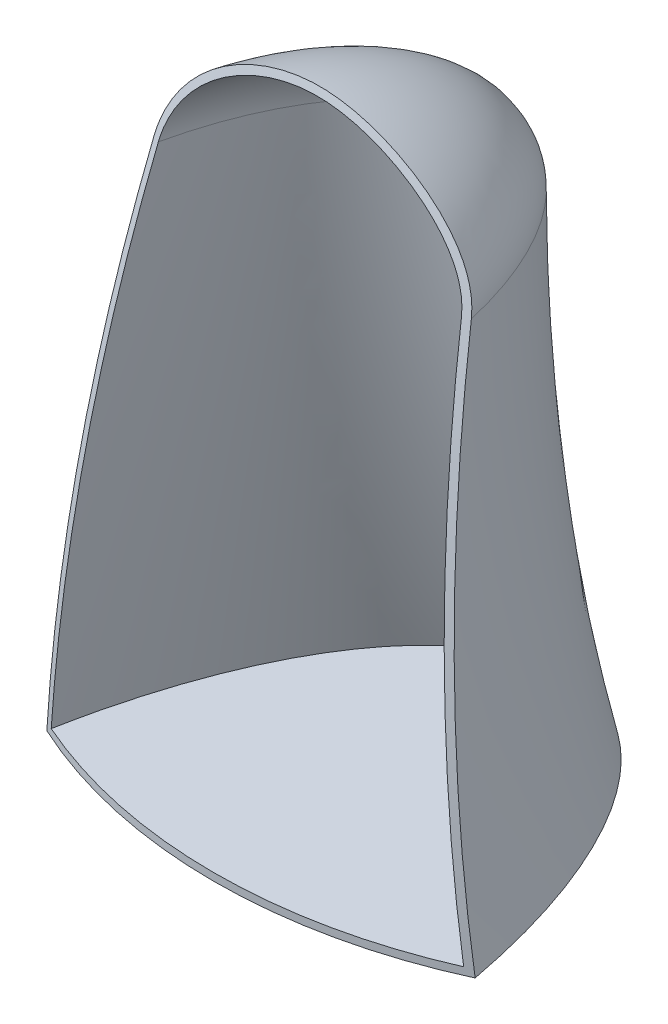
ISO-10303-21;
HEADER;
FILE_DESCRIPTION(('STEP AP214'),'2;1');
FILE_NAME('part.step','',(''),(''),'','','');
FILE_SCHEMA(('AUTOMOTIVE_DESIGN { 1 0 10303 214 1 1 1 1 }'));
ENDSEC;
DATA;
#1=APPLICATION_CONTEXT('core data for automotive mechanical design processes');
#2=APPLICATION_PROTOCOL_DEFINITION('international standard','automotive_design',2000,#1);
#3=PRODUCT_CONTEXT('',#1,'mechanical');
#4=PRODUCT('Part','Part','',(#3));
#5=PRODUCT_RELATED_PRODUCT_CATEGORY('part','',(#4));
#6=PRODUCT_DEFINITION_FORMATION('','',#4);
#7=PRODUCT_DEFINITION_CONTEXT('part definition',#1,'design');
#8=PRODUCT_DEFINITION('design','',#6,#7);
#9=PRODUCT_DEFINITION_SHAPE('','',#8);
#10=(LENGTH_UNIT() NAMED_UNIT(*) SI_UNIT(.MILLI.,.METRE.));
#11=(NAMED_UNIT(*) PLANE_ANGLE_UNIT() SI_UNIT($,.RADIAN.));
#12=(NAMED_UNIT(*) SI_UNIT($,.STERADIAN.) SOLID_ANGLE_UNIT());
#13=UNCERTAINTY_MEASURE_WITH_UNIT(LENGTH_MEASURE(1.E-05),#10,'distance_accuracy_value','');
#14=(GEOMETRIC_REPRESENTATION_CONTEXT(3) GLOBAL_UNCERTAINTY_ASSIGNED_CONTEXT((#13)) GLOBAL_UNIT_ASSIGNED_CONTEXT((#10,
#11,#12)) REPRESENTATION_CONTEXT('',''));
#15=CARTESIAN_POINT('',(0.,0.,0.));
#16=DIRECTION('',(0.,0.,1.));
#17=DIRECTION('',(1.,0.,0.));
#18=AXIS2_PLACEMENT_3D('',#15,#16,#17);
#19=CARTESIAN_POINT('',(0.,0.,-250.));
#20=DIRECTION('',(0.,1.,0.));
#21=DIRECTION('',(0.,0.,1.));
#22=AXIS2_PLACEMENT_3D('',#19,#20,#21);
#23=DEGENERATE_TOROIDAL_SURFACE('',#22,675.000000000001,912.300000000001,.F.);
#24=CARTESIAN_POINT('',(99.9031877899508,-4.96216162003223,-34.7693366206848));
#25=CARTESIAN_POINT('',(99.0945999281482,2.59380703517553,-34.3487425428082));
#26=CARTESIAN_POINT('',(98.2863339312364,10.1558003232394,-34.0374600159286));
#27=CARTESIAN_POINT('',(96.6705869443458,25.2856366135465,-33.6312764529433));
#28=CARTESIAN_POINT('',(95.8631059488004,32.8534795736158,-33.5363738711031));
#29=CARTESIAN_POINT('',(94.2492636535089,47.9870017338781,-33.5606995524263));
#30=CARTESIAN_POINT('',(93.4429021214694,55.5526809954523,-33.6798734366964));
#31=CARTESIAN_POINT('',(91.831145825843,70.6776139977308,-34.1301411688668));
#32=CARTESIAN_POINT('',(91.0257510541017,78.2368677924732,-34.4612332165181));
#33=CARTESIAN_POINT('',(88.8417594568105,98.7305693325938,-35.6443330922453));
#34=CARTESIAN_POINT('',(87.4639890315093,111.653872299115,-36.6994438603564));
#35=CARTESIAN_POINT('',(84.7103282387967,137.437118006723,-39.4160239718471));
#36=CARTESIAN_POINT('',(83.3344379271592,150.297058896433,-41.0775109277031));
#37=CARTESIAN_POINT('',(81.2649064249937,169.573851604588,-44.0255724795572));
#38=CARTESIAN_POINT('',(80.5710721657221,176.025393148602,-45.0898895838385));
#39=CARTESIAN_POINT('',(79.1831583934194,188.901941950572,-47.3690387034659));
#40=CARTESIAN_POINT('',(78.4890788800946,195.326949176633,-48.5838708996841));
#41=CARTESIAN_POINT('',(77.1003640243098,208.146440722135,-51.1626636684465));
#42=CARTESIAN_POINT('',(76.4057287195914,214.540926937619,-52.5266148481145));
#43=CARTESIAN_POINT('',(75.0153474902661,227.296408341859,-55.4023795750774));
#44=CARTESIAN_POINT('',(74.3196015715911,233.657403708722,-56.9141923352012));
#45=CARTESIAN_POINT('',(73.6230410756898,240.000000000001,-58.4992789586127));
#46=B_SPLINE_CURVE_WITH_KNOTS('',3,(#24,#25,#26,#27,#28,#29,#30,#31,#32,#33,#34,#35,#36,#37,#38,
#39,#40,#41,#42,#43,#44,#45),.UNSPECIFIED.,.F.,.F.,(4,2,2,2,2,2,2,2,2,2,4),(0.,22.8312890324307,
45.6624149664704,68.4877422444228,91.3128756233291,130.415571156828,169.519402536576,
189.244276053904,208.96917327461,228.692828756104,248.416379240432),.UNSPECIFIED.);
#47=CARTESIAN_POINT('',(99.3723127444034,0.,-34.5088552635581));
#48=VERTEX_POINT('',#47);
#49=CARTESIAN_POINT('',(73.6230423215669,240.,-58.4992792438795));
#50=VERTEX_POINT('',#49);
#51=EDGE_CURVE('E222',#48,#50,#46,.T.);
#52=ORIENTED_EDGE('',*,*,#51,.T.);
#53=CARTESIAN_POINT('',(73.6230434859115,240.,-58.4992798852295));
#54=CARTESIAN_POINT('',(73.5540073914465,240.628715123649,-58.6564147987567));
#55=CARTESIAN_POINT('',(73.4665873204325,241.256910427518,-58.8070908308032));
#56=CARTESIAN_POINT('',(73.2570629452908,242.50942099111,-59.0955618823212));
#57=CARTESIAN_POINT('',(73.1350132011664,243.133740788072,-59.233376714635));
#58=CARTESIAN_POINT('',(72.8581499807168,244.37734881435,-59.4965908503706));
#59=CARTESIAN_POINT('',(72.7033519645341,244.996639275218,-59.6219959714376));
#60=CARTESIAN_POINT('',(72.3645709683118,246.223172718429,-59.8597836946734));
#61=CARTESIAN_POINT('',(72.18087713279,246.830474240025,-59.9722780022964));
#62=CARTESIAN_POINT('',(71.7851233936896,248.038010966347,-60.1861634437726));
#63=CARTESIAN_POINT('',(71.57305214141,248.638243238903,-60.287550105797));
#64=CARTESIAN_POINT('',(71.122463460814,249.830497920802,-60.4797779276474));
#65=CARTESIAN_POINT('',(70.8839393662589,250.422518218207,-60.5706164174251));
#66=CARTESIAN_POINT('',(70.0597277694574,252.352889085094,-60.8527832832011));
#67=CARTESIAN_POINT('',(69.4218715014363,253.672484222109,-61.0232067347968));
#68=CARTESIAN_POINT('',(68.3835517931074,255.611083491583,-61.2457672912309));
#69=CARTESIAN_POINT('',(68.0237349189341,256.250671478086,-61.3144574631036));
#70=CARTESIAN_POINT('',(67.2788947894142,257.516036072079,-61.441795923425));
#71=CARTESIAN_POINT('',(66.8938726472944,258.141813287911,-61.5004446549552));
#72=CARTESIAN_POINT('',(65.6993526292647,260.005049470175,-61.6633520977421));
#73=CARTESIAN_POINT('',(64.854351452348,261.221109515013,-61.7537552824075));
#74=CARTESIAN_POINT('',(63.0837851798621,263.59450048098,-61.9046951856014));
#75=CARTESIAN_POINT('',(62.1582193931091,264.751830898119,-61.965231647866));
#76=CARTESIAN_POINT('',(60.2295624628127,267.016317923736,-62.0629173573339));
#77=CARTESIAN_POINT('',(59.225929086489,268.123019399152,-62.0998828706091));
#78=CARTESIAN_POINT('',(57.1556685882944,270.276993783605,-62.1550354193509));
#79=CARTESIAN_POINT('',(56.0890162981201,271.324242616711,-62.1732148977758));
#80=CARTESIAN_POINT('',(53.8997410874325,273.358931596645,-62.1953108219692));
#81=CARTESIAN_POINT('',(52.7771084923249,274.346361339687,-62.1992247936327));
#82=CARTESIAN_POINT('',(50.4813071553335,276.261079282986,-62.1966178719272));
#83=CARTESIAN_POINT('',(49.3081264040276,277.188353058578,-62.1900944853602));
#84=CARTESIAN_POINT('',(46.9162816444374,278.981560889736,-62.1698417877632));
#85=CARTESIAN_POINT('',(45.6976274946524,279.847508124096,-62.156114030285));
#86=CARTESIAN_POINT('',(43.2184212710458,281.517077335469,-62.1241606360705));
#87=CARTESIAN_POINT('',(41.9578689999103,282.320699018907,-62.1059349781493));
#88=CARTESIAN_POINT('',(39.3573214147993,283.888559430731,-62.0666227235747));
#89=CARTESIAN_POINT('',(38.0160746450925,284.650721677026,-62.0454633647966));
#90=CARTESIAN_POINT('',(35.2957847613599,286.104446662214,-62.0027833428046));
#91=CARTESIAN_POINT('',(33.9167403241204,286.796006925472,-61.981262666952));
#92=CARTESIAN_POINT('',(31.123967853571,288.105507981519,-61.9394687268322));
#93=CARTESIAN_POINT('',(29.710237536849,288.723443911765,-61.9191955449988));
#94=CARTESIAN_POINT('',(26.8536999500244,289.881078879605,-61.8811464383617));
#95=CARTESIAN_POINT('',(25.4109438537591,290.420903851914,-61.8633664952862));
#96=CARTESIAN_POINT('',(22.4976052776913,291.419327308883,-61.8310937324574));
#97=CARTESIAN_POINT('',(21.0270242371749,291.877929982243,-61.8166007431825));
#98=CARTESIAN_POINT('',(18.0616601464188,292.709295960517,-61.79134668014));
#99=CARTESIAN_POINT('',(16.5668779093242,293.082062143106,-61.7805854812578));
#100=CARTESIAN_POINT('',(14.0920310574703,293.620417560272,-61.7659831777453));
#101=CARTESIAN_POINT('',(13.1176838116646,293.812570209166,-61.7610417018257));
#102=CARTESIAN_POINT('',(11.1620725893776,294.157658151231,-61.7526386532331));
#103=CARTESIAN_POINT('',(10.18080898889,294.310595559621,-61.7491770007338));
#104=CARTESIAN_POINT('',(8.21295776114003,294.575799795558,-61.7435825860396));
#105=CARTESIAN_POINT('',(7.22637108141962,294.68807363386,-61.7414495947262));
#106=CARTESIAN_POINT('',(5.24944394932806,294.870541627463,-61.7382802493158));
#107=CARTESIAN_POINT('',(4.2591040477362,294.940741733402,-61.7372437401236));
#108=CARTESIAN_POINT('',(2.27707677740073,295.037672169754,-61.7359691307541));
#109=CARTESIAN_POINT('',(1.28539124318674,295.064439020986,-61.7357303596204));
#110=CARTESIAN_POINT('',(-0.202273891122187,295.071039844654,-61.7356648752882));
#111=CARTESIAN_POINT('',(-0.698226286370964,295.067646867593,-61.7356918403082));
#112=CARTESIAN_POINT('',(-1.68993191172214,295.049776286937,-61.7358736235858));
#113=CARTESIAN_POINT('',(-2.18568514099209,295.035298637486,-61.7360284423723));
#114=CARTESIAN_POINT('',(-3.67236878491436,294.97549726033,-61.7367644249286));
#115=CARTESIAN_POINT('',(-4.66268768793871,294.913804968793,-61.7376171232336));
#116=CARTESIAN_POINT('',(-6.63967310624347,294.748147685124,-61.7403632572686));
#117=CARTESIAN_POINT('',(-7.62633974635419,294.644184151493,-61.7422566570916));
#118=CARTESIAN_POINT('',(-9.91735952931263,294.354591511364,-61.7481645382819));
#119=CARTESIAN_POINT('',(-11.2197644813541,294.153360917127,-61.7526710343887));
#120=CARTESIAN_POINT('',(-13.8119774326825,293.682208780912,-61.7643256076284));
#121=CARTESIAN_POINT('',(-15.1017854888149,293.412287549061,-61.7714736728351));
#122=CARTESIAN_POINT('',(-17.6659072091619,292.807030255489,-61.7885463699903));
#123=CARTESIAN_POINT('',(-18.9402209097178,292.471694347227,-61.7984709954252));
#124=CARTESIAN_POINT('',(-21.4731995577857,291.738010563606,-61.821035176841));
#125=CARTESIAN_POINT('',(-22.7318292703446,291.339541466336,-61.8336799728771));
#126=CARTESIAN_POINT('',(-25.2285222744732,290.482985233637,-61.8613742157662));
#127=CARTESIAN_POINT('',(-26.4665863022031,290.024900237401,-61.8764235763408));
#128=CARTESIAN_POINT('',(-28.920124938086,289.051709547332,-61.9084230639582));
#129=CARTESIAN_POINT('',(-30.1355985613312,288.536601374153,-61.9253732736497));
#130=CARTESIAN_POINT('',(-32.3547943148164,287.536069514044,-61.9577310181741));
#131=CARTESIAN_POINT('',(-33.3620623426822,287.058478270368,-61.9729687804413));
#132=CARTESIAN_POINT('',(-35.3578854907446,286.065506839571,-62.0037435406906));
#133=CARTESIAN_POINT('',(-36.3464393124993,285.550124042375,-62.0192805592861));
#134=CARTESIAN_POINT('',(-38.3036801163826,284.482608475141,-62.0500009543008));
#135=CARTESIAN_POINT('',(-39.2723642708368,283.930470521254,-62.0651842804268));
#136=CARTESIAN_POINT('',(-41.1884449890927,282.790439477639,-62.0944245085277));
#137=CARTESIAN_POINT('',(-42.1358420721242,282.202547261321,-62.1084814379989));
#138=CARTESIAN_POINT('',(-44.0075733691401,280.992046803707,-62.1345696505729));
#139=CARTESIAN_POINT('',(-44.9319185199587,280.369455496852,-62.146601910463));
#140=CARTESIAN_POINT('',(-46.7565746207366,279.089879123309,-62.1676233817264));
#141=CARTESIAN_POINT('',(-47.6568848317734,278.432893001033,-62.1766124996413));
#142=CARTESIAN_POINT('',(-49.4315994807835,277.085140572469,-62.1903721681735));
#143=CARTESIAN_POINT('',(-50.3060094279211,276.394381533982,-62.1951436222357));
#144=CARTESIAN_POINT('',(-52.0271581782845,274.979334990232,-62.1991341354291));
#145=CARTESIAN_POINT('',(-52.8738996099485,274.255050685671,-62.1983537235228));
#146=CARTESIAN_POINT('',(-54.5576977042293,272.755201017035,-62.1896183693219));
#147=CARTESIAN_POINT('',(-55.3940279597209,271.978820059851,-62.1814908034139));
#148=CARTESIAN_POINT('',(-57.0326859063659,270.391176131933,-62.1559654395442));
#149=CARTESIAN_POINT('',(-57.8350158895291,269.57991551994,-62.1385682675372));
#150=CARTESIAN_POINT('',(-59.402635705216,267.922343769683,-62.0923914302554));
#151=CARTESIAN_POINT('',(-60.1679190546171,267.07602654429,-62.0636097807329));
#152=CARTESIAN_POINT('',(-61.6570274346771,265.348978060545,-61.992294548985));
#153=CARTESIAN_POINT('',(-62.3808754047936,264.468266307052,-61.9497686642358));
#154=CARTESIAN_POINT('',(-63.7829039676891,262.672200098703,-61.8482789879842));
#155=CARTESIAN_POINT('',(-64.461090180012,261.756849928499,-61.7893172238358));
#156=CARTESIAN_POINT('',(-65.7661801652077,259.892086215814,-61.651979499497));
#157=CARTESIAN_POINT('',(-66.3931027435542,258.942685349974,-61.5736107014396));
#158=CARTESIAN_POINT('',(-67.6089829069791,256.978721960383,-61.3912231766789));
#159=CARTESIAN_POINT('',(-68.1960357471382,255.963044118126,-61.2864513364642));
#160=CARTESIAN_POINT('',(-69.3004668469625,253.897368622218,-61.0487644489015));
#161=CARTESIAN_POINT('',(-69.8178405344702,252.84736872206,-60.9158475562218));
#162=CARTESIAN_POINT('',(-70.7712904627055,250.719998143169,-60.618396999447));
#163=CARTESIAN_POINT('',(-71.2076648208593,249.642745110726,-60.4539839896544));
#164=CARTESIAN_POINT('',(-71.9903849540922,247.462314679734,-60.0894579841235));
#165=CARTESIAN_POINT('',(-72.3367876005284,246.359154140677,-59.8893676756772));
#166=CARTESIAN_POINT('',(-72.8623161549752,244.381444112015,-59.4991210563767));
#167=CARTESIAN_POINT('',(-73.0615160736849,243.510723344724,-59.3166846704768));
#168=CARTESIAN_POINT('',(-73.3104774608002,242.198483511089,-59.0244228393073));
#169=CARTESIAN_POINT('',(-73.3852116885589,241.759567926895,-58.9237826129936));
#170=CARTESIAN_POINT('',(-73.5173232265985,240.880522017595,-58.7162456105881));
#171=CARTESIAN_POINT('',(-73.5746973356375,240.440391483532,-58.6093476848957));
#172=CARTESIAN_POINT('',(-73.6230713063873,240.,-58.4992905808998));
#173=B_SPLINE_CURVE_WITH_KNOTS('',3,(#53,#54,#55,#56,#57,#58,#59,#60,#61,#62,#63,#64,#65,#66,
#67,#68,#69,#70,#71,#72,#73,#74,#75,#76,#77,#78,#79,#80,#81,#82,#83,#84,#85,#86,#87,#88,#89,#90,
#91,#92,#93,#94,#95,#96,#97,#98,#99,#100,#101,#102,#103,#104,#105,#106,#107,#108,#109,#110,#111,
#112,#113,#114,#115,#116,#117,#118,#119,#120,#121,#122,#123,#124,#125,#126,#127,#128,#129,#130,
#131,#132,#133,#134,#135,#136,#137,#138,#139,#140,#141,#142,#143,#144,#145,#146,#147,#148,#149,
#150,#151,#152,#153,#154,#155,#156,#157,#158,#159,#160,#161,#162,#163,#164,#165,#166,#167,#168,
#169,#170,#171,#172),.UNSPECIFIED.,.F.,.F.,(4,2,2,2,2,2,2,2,2,2,2,2,2,2,2,2,2,2,2,2,2,2,2,2,2,2,
2,2,2,2,2,2,2,2,2,2,2,2,2,2,2,2,2,2,2,2,2,2,2,2,2,2,2,2,2,2,2,2,2,4),(0.,1.95470940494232,
3.90635605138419,5.85708339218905,7.78940535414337,9.72250241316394,11.6560877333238,
16.074906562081,18.2856527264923,20.4963013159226,24.942555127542,29.3888470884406,
33.8693870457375,38.3517286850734,42.8348476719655,47.3190377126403,51.8022611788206,
56.2855057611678,60.9118841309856,65.5384246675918,70.1652705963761,74.7845717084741,
79.403634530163,84.0225424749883,87.0012126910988,89.9797222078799,92.9577179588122,
95.9352924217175,98.9103618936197,100.398143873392,101.885932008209,104.861614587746,
107.83719450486,111.788763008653,115.740313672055,119.691855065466,123.651077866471,
127.610158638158,131.569411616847,134.913215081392,138.257249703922,141.601756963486,
144.946182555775,148.288989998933,151.631900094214,154.974093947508,158.31596937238,
161.738463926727,165.16072739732,168.58358761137,172.004534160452,175.425058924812,
178.844323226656,182.375091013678,185.90609036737,189.423824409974,192.939329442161,
195.67154584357,197.040605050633,198.40991656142),.UNSPECIFIED.);
#174=CARTESIAN_POINT('',(-73.6230566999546,240.,-58.4992825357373));
#175=VERTEX_POINT('',#174);
#176=EDGE_CURVE('E227',#50,#175,#173,.T.);
#177=ORIENTED_EDGE('',*,*,#176,.T.);
#178=CARTESIAN_POINT('',(-73.6230410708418,240.000000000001,-58.4992789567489));
#179=CARTESIAN_POINT('',(-74.4290431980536,232.660750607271,-56.6651121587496));
#180=CARTESIAN_POINT('',(-75.2339737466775,225.296855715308,-54.9290616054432));
#181=CARTESIAN_POINT('',(-76.8424699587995,210.524806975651,-51.6551925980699));
#182=CARTESIAN_POINT('',(-77.646035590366,203.116652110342,-50.1173787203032));
#183=CARTESIAN_POINT('',(-79.2525538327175,188.261355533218,-47.2420483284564));
#184=CARTESIAN_POINT('',(-80.0555064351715,180.814213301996,-45.9045344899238));
#185=CARTESIAN_POINT('',(-81.6612790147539,165.886660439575,-43.4318442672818));
#186=CARTESIAN_POINT('',(-82.4640989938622,158.406250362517,-42.2966645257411));
#187=CARTESIAN_POINT('',(-84.6428730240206,138.070946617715,-39.4936077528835));
#188=CARTESIAN_POINT('',(-86.0191834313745,125.188330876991,-38.0233106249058));
#189=CARTESIAN_POINT('',(-88.7739474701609,99.3691872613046,-35.6922030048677));
#190=CARTESIAN_POINT('',(-90.1524009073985,86.4326641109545,-34.8313401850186));
#191=CARTESIAN_POINT('',(-92.228342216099,66.9502499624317,-34.0019289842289));
#192=CARTESIAN_POINT('',(-92.9248732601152,60.413388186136,-33.8026016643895));
#193=CARTESIAN_POINT('',(-94.3186478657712,47.3367152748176,-33.5629035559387));
#194=CARTESIAN_POINT('',(-95.0158914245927,40.7969041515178,-33.5225321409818));
#195=CARTESIAN_POINT('',(-96.4111499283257,27.7173248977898,-33.6021321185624));
#196=CARTESIAN_POINT('',(-97.1091649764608,21.1775569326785,-33.7221284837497));
#197=CARTESIAN_POINT('',(-98.5057712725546,8.10296847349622,-34.1239742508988));
#198=CARTESIAN_POINT('',(-99.2043625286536,1.56814805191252,-34.4058259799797));
#199=CARTESIAN_POINT('',(-99.9031884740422,-4.96216162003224,-34.7693369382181));
#200=B_SPLINE_CURVE_WITH_KNOTS('',3,(#178,#179,#180,#181,#182,#183,#184,#185,#186,#187,#188,
#189,#190,#191,#192,#193,#194,#195,#196,#197,#198,#199),.UNSPECIFIED.,.F.,.F.,(4,2,2,2,2,2,2,2,
2,2,4),(0.,22.8226837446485,45.6458942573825,68.4694096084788,91.2925462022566,130.39494220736,
169.493980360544,189.223039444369,208.952020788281,228.684074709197,248.416412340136),.UNSPECIFIED.);
#201=CARTESIAN_POINT('',(-99.3723127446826,0.,-34.5088552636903));
#202=VERTEX_POINT('',#201);
#203=EDGE_CURVE('E225',#175,#202,#200,.T.);
#204=ORIENTED_EDGE('',*,*,#203,.T.);
#205=CARTESIAN_POINT('',(0.,0.,-250.));
#206=DIRECTION('',(0.,-1.,0.));
#207=DIRECTION('',(0.,0.,-1.));
#208=AXIS2_PLACEMENT_3D('',#205,#206,#207);
#209=CIRCLE('',#208,237.3);
#210=EDGE_CURVE('E104',#48,#202,#209,.T.);
#211=ORIENTED_EDGE('',*,*,#210,.F.);
#212=EDGE_LOOP('',(#52,#177,#204,#211));
#213=FACE_BOUND('',#212,.T.);
#214=CARTESIAN_POINT('',(95.6931461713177,3.5,-32.8573615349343));
#215=CARTESIAN_POINT('',(94.9458324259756,10.4769940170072,-32.5572995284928));
#216=CARTESIAN_POINT('',(94.1989512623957,17.4579284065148,-32.3493402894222));
#217=CARTESIAN_POINT('',(92.7061308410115,31.4228941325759,-32.1159614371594));
#218=CARTESIAN_POINT('',(91.9601915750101,38.4069254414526,-32.0905402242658));
#219=CARTESIAN_POINT('',(90.4694460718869,52.3722294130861,-32.2205551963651));
#220=CARTESIAN_POINT('',(89.724639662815,59.3535023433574,-32.3759604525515));
#221=CARTESIAN_POINT('',(88.2360500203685,73.309707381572,-32.8659879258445));
#222=CARTESIAN_POINT('',(87.4922667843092,80.2846395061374,-33.2006096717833));
#223=CARTESIAN_POINT('',(85.3834210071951,100.058299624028,-34.4020519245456));
#224=CARTESIAN_POINT('',(84.0194449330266,112.84488180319,-35.4798960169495));
#225=CARTESIAN_POINT('',(81.2939394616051,138.355115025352,-38.2261087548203));
#226=CARTESIAN_POINT('',(79.9324101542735,151.078763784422,-39.894498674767));
#227=CARTESIAN_POINT('',(77.8851317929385,170.149953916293,-42.8411210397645));
#228=CARTESIAN_POINT('',(77.1989620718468,176.531597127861,-43.9027802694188));
#229=CARTESIAN_POINT('',(75.8265493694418,189.268883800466,-46.1726761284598));
#230=CARTESIAN_POINT('',(75.140306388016,195.624527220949,-47.3809129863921));
#231=CARTESIAN_POINT('',(73.7674561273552,208.30595073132,-49.9426243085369));
#232=CARTESIAN_POINT('',(73.0808488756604,214.631732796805,-51.2960890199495));
#233=CARTESIAN_POINT('',(71.7067392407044,227.250626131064,-54.1470407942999));
#234=CARTESIAN_POINT('',(71.0192368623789,233.543737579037,-55.644527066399));
#235=CARTESIAN_POINT('',(70.3310407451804,239.81892998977,-57.2133907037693));
#236=B_SPLINE_CURVE_WITH_KNOTS('',3,(#214,#215,#216,#217,#218,#219,#220,#221,#222,#223,#224,
#225,#226,#227,#228,#229,#230,#231,#232,#233,#234,#235),.UNSPECIFIED.,.F.,.F.,(4,2,2,2,2,2,2,2,
2,2,4),(0.,21.0692357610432,42.1382868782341,63.2037348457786,84.2691274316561,122.967123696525,
161.666514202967,181.182003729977,200.69752368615,220.211733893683,239.725836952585),.UNSPECIFIED.);
#237=CARTESIAN_POINT('',(95.6931461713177,3.5,-32.8573615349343));
#238=VERTEX_POINT('',#237);
#239=CARTESIAN_POINT('',(70.3310424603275,239.818930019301,-57.2133913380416));
#240=VERTEX_POINT('',#239);
#241=EDGE_CURVE('E110',#238,#240,#236,.T.);
#242=ORIENTED_EDGE('',*,*,#241,.F.);
#243=CARTESIAN_POINT('',(0.,3.5,-250.));
#244=DIRECTION('',(0.,1.,0.));
#245=DIRECTION('',(0.,0.,1.));
#246=AXIS2_PLACEMENT_3D('',#243,#244,#245);
#247=CIRCLE('',#246,237.293286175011);
#248=CARTESIAN_POINT('',(-95.6931456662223,3.5,-32.8573613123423));
#249=VERTEX_POINT('',#248);
#250=EDGE_CURVE('E121',#238,#249,#247,.F.);
#251=ORIENTED_EDGE('',*,*,#250,.T.);
#252=CARTESIAN_POINT('',(-70.3310395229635,239.818941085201,-57.2133934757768));
#253=CARTESIAN_POINT('',(-71.0738550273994,233.045658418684,-55.5199994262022));
#254=CARTESIAN_POINT('',(-71.8158700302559,226.25149510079,-53.9097659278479));
#255=CARTESIAN_POINT('',(-73.2989086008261,212.625352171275,-50.8571971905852));
#256=CARTESIAN_POINT('',(-74.0399321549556,205.793372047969,-49.4148642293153));
#257=CARTESIAN_POINT('',(-75.5216108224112,192.095414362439,-46.6996582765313));
#258=CARTESIAN_POINT('',(-76.2622659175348,185.22943527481,-45.4267929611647));
#259=CARTESIAN_POINT('',(-77.7435753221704,171.468136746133,-43.0521725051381));
#260=CARTESIAN_POINT('',(-78.4842296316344,164.572817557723,-41.9504158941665));
#261=CARTESIAN_POINT('',(-80.5861565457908,144.973280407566,-39.0693480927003));
#262=CARTESIAN_POINT('',(-81.9479265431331,132.238408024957,-37.4949322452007));
#263=CARTESIAN_POINT('',(-84.6740547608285,106.710302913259,-34.9381082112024));
#264=CARTESIAN_POINT('',(-86.0384128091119,93.9170739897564,-33.9556619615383));
#265=CARTESIAN_POINT('',(-88.093343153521,74.6481605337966,-32.9298634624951));
#266=CARTESIAN_POINT('',(-88.7827461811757,68.1836225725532,-32.6624032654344));
#267=CARTESIAN_POINT('',(-90.1624307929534,55.2499927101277,-32.2816413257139));
#268=CARTESIAN_POINT('',(-90.8527123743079,48.7809008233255,-32.1683390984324));
#269=CARTESIAN_POINT('',(-92.2342211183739,35.8411432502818,-32.0971605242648));
#270=CARTESIAN_POINT('',(-92.9254483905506,29.3704774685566,-32.1393040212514));
#271=CARTESIAN_POINT('',(-94.3087093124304,16.4320787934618,-32.3803945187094));
#272=CARTESIAN_POINT('',(-95.0007429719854,9.96434593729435,-32.5793434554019));
#273=CARTESIAN_POINT('',(-95.6931456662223,3.5,-32.8573613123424));
#274=B_SPLINE_CURVE_WITH_KNOTS('',3,(#252,#253,#254,#255,#256,#257,#258,#259,#260,#261,#262,
#263,#264,#265,#266,#267,#268,#269,#270,#271,#272,#273),.UNSPECIFIED.,.F.,.F.,(4,2,2,2,2,2,2,2,
2,2,4),(0.,21.0629572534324,42.126200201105,63.1903968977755,84.2544125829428,122.951753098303,
161.646605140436,181.165158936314,200.683651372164,220.204635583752,239.725860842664),.UNSPECIFIED.);
#275=CARTESIAN_POINT('',(-70.3310574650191,239.818941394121,-57.2134001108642));
#276=VERTEX_POINT('',#275);
#277=EDGE_CURVE('E173',#276,#249,#274,.T.);
#278=ORIENTED_EDGE('',*,*,#277,.F.);
#279=CARTESIAN_POINT('',(70.3310424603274,239.818930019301,-57.2133913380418));
#280=CARTESIAN_POINT('',(70.2694434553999,240.380656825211,-57.353836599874));
#281=CARTESIAN_POINT('',(70.1912578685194,240.941848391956,-57.4886794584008));
#282=CARTESIAN_POINT('',(70.0039319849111,242.059813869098,-57.7470515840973));
#283=CARTESIAN_POINT('',(69.8948876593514,242.61659605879,-57.8706143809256));
#284=CARTESIAN_POINT('',(69.6478403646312,243.725061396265,-58.1070052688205));
#285=CARTESIAN_POINT('',(69.5098799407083,244.276750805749,-58.2198487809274));
#286=CARTESIAN_POINT('',(69.2068985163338,245.374411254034,-58.4354023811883));
#287=CARTESIAN_POINT('',(69.0418869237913,245.920384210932,-58.538115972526));
#288=CARTESIAN_POINT('',(68.6891874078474,246.998049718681,-58.7325578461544));
#289=CARTESIAN_POINT('',(68.5018559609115,247.529834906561,-58.8244217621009));
#290=CARTESIAN_POINT('',(68.104307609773,248.586593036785,-58.9994083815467));
#291=CARTESIAN_POINT('',(67.8940769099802,249.111561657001,-59.0825257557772));
#292=CARTESIAN_POINT('',(67.452332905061,250.154037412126,-59.2405448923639));
#293=CARTESIAN_POINT('',(67.2208085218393,250.671540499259,-59.3154423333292));
#294=CARTESIAN_POINT('',(66.7380619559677,251.698398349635,-59.4575318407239));
#295=CARTESIAN_POINT('',(66.4868371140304,252.207752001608,-59.5247228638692));
#296=CARTESIAN_POINT('',(65.7630794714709,253.611781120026,-59.7015430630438));
#297=CARTESIAN_POINT('',(65.2707062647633,254.497273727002,-59.8034188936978));
#298=CARTESIAN_POINT('',(64.2350894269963,256.239894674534,-59.9874375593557));
#299=CARTESIAN_POINT('',(63.6918448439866,257.097022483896,-60.0695800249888));
#300=CARTESIAN_POINT('',(62.5602613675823,258.782445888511,-60.2168776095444));
#301=CARTESIAN_POINT('',(61.9719210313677,259.610740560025,-60.2820321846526));
#302=CARTESIAN_POINT('',(60.7507542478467,261.243989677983,-60.3982260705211));
#303=CARTESIAN_POINT('',(60.1176423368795,262.048737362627,-60.4491621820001));
#304=CARTESIAN_POINT('',(58.8148919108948,263.62863299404,-60.5385492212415));
#305=CARTESIAN_POINT('',(58.1452569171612,264.403783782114,-60.5770013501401));
#306=CARTESIAN_POINT('',(56.7728135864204,265.924703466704,-60.643417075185));
#307=CARTESIAN_POINT('',(56.0700006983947,266.670468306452,-60.671379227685));
#308=CARTESIAN_POINT('',(54.2817275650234,268.491548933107,-60.730166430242));
#309=CARTESIAN_POINT('',(53.1777764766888,269.548944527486,-60.7556596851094));
#310=CARTESIAN_POINT('',(50.9103938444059,271.598707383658,-60.7922477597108));
#311=CARTESIAN_POINT('',(49.7469418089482,272.591051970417,-60.8033375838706));
#312=CARTESIAN_POINT('',(47.3668099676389,274.510148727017,-60.8152020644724));
#313=CARTESIAN_POINT('',(46.1501209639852,275.43688948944,-60.8159749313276));
#314=CARTESIAN_POINT('',(43.6686101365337,277.223705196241,-60.8105838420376));
#315=CARTESIAN_POINT('',(42.4037834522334,278.083773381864,-60.8044191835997));
#316=CARTESIAN_POINT('',(39.8305705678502,279.73539948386,-60.7879252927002));
#317=CARTESIAN_POINT('',(38.52219311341,280.526971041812,-60.7775968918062));
#318=CARTESIAN_POINT('',(35.8652869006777,282.039578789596,-60.755021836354));
#319=CARTESIAN_POINT('',(34.5167591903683,282.760616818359,-60.7427752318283));
#320=CARTESIAN_POINT('',(32.1052092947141,283.967920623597,-60.7210361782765));
#321=CARTESIAN_POINT('',(31.0498061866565,284.469466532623,-60.711574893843));
#322=CARTESIAN_POINT('',(28.9189132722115,285.42813862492,-60.6931782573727));
#323=CARTESIAN_POINT('',(27.843422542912,285.885262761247,-60.6842429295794));
#324=CARTESIAN_POINT('',(25.6738554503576,286.753302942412,-60.6673781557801));
#325=CARTESIAN_POINT('',(24.5797779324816,287.164216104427,-60.6594487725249));
#326=CARTESIAN_POINT('',(22.3744363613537,287.937889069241,-60.6449307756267));
#327=CARTESIAN_POINT('',(21.2631687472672,288.300638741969,-60.6383424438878));
#328=CARTESIAN_POINT('',(19.0292303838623,288.974516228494,-60.6267218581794));
#329=CARTESIAN_POINT('',(17.9066120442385,289.28581741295,-60.6216843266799));
#330=CARTESIAN_POINT('',(15.6480926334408,289.855942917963,-60.6131804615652));
#331=CARTESIAN_POINT('',(14.5121915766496,290.114767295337,-60.6097141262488));
#332=CARTESIAN_POINT('',(12.2294621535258,290.577375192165,-60.6042489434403));
#333=CARTESIAN_POINT('',(11.0826362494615,290.78117082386,-60.6022497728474));
#334=CARTESIAN_POINT('',(8.78039715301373,291.131149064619,-60.5994581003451));
#335=CARTESIAN_POINT('',(7.62498559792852,291.277342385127,-60.5986653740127));
#336=CARTESIAN_POINT('',(5.3839983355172,291.501915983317,-60.5978922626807));
#337=CARTESIAN_POINT('',(4.29880526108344,291.58411073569,-60.5978620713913));
#338=CARTESIAN_POINT('',(2.12556390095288,291.693787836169,-60.5980130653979));
#339=CARTESIAN_POINT('',(1.03751549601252,291.721267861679,-60.5981942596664));
#340=CARTESIAN_POINT('',(-1.13851032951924,291.719532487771,-60.5981888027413));
#341=CARTESIAN_POINT('',(-2.2264877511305,291.690318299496,-60.5980021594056));
#342=CARTESIAN_POINT('',(-4.39946074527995,291.577257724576,-60.5978622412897));
#343=CARTESIAN_POINT('',(-5.48445657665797,291.493416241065,-60.5979089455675));
#344=CARTESIAN_POINT('',(-7.65098808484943,291.273031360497,-60.5986998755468));
#345=CARTESIAN_POINT('',(-8.73251428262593,291.136395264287,-60.5994453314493));
#346=CARTESIAN_POINT('',(-10.8880691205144,290.812588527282,-60.6019813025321));
#347=CARTESIAN_POINT('',(-11.9620968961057,290.625412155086,-60.6037719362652));
#348=CARTESIAN_POINT('',(-14.100740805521,290.202642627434,-60.6086203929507));
#349=CARTESIAN_POINT('',(-15.1653553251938,289.967041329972,-60.6116784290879));
#350=CARTESIAN_POINT('',(-17.2832445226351,289.449513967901,-60.6191635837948));
#351=CARTESIAN_POINT('',(-18.3365190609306,289.167587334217,-60.6235907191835));
#352=CARTESIAN_POINT('',(-20.5054801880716,288.537491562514,-60.6341684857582));
#353=CARTESIAN_POINT('',(-21.6202056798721,288.186016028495,-60.6404201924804));
#354=CARTESIAN_POINT('',(-23.8329434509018,287.434385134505,-60.6543219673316));
#355=CARTESIAN_POINT('',(-24.9309575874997,287.034235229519,-60.6619718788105));
#356=CARTESIAN_POINT('',(-27.1088518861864,286.187250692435,-60.6783666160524));
#357=CARTESIAN_POINT('',(-28.1887313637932,285.740414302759,-60.6871114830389));
#358=CARTESIAN_POINT('',(-30.3288567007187,284.801875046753,-60.7052504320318));
#359=CARTESIAN_POINT('',(-31.3891015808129,284.310169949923,-60.7146445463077));
#360=CARTESIAN_POINT('',(-33.4893723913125,283.283056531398,-60.733501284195));
#361=CARTESIAN_POINT('',(-34.529379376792,282.7476094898,-60.7429639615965));
#362=CARTESIAN_POINT('',(-36.5866558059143,281.63480205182,-60.761211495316));
#363=CARTESIAN_POINT('',(-37.6039263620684,281.05744371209,-60.7699963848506));
#364=CARTESIAN_POINT('',(-39.6141482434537,279.86198634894,-60.7859961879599));
#365=CARTESIAN_POINT('',(-40.6071014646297,279.243890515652,-60.793211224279));
#366=CARTESIAN_POINT('',(-42.5669640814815,277.967919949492,-60.8050118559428));
#367=CARTESIAN_POINT('',(-43.533876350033,277.310049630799,-60.8095977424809));
#368=CARTESIAN_POINT('',(-45.5638227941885,275.867081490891,-60.8152478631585));
#369=CARTESIAN_POINT('',(-46.6230128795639,275.076561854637,-60.8157768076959));
#370=CARTESIAN_POINT('',(-48.7026997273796,273.446293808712,-60.8097933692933));
#371=CARTESIAN_POINT('',(-49.7231989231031,272.606548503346,-60.8032814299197));
#372=CARTESIAN_POINT('',(-51.7221059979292,270.877926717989,-60.7807201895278));
#373=CARTESIAN_POINT('',(-52.7005032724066,269.989037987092,-60.7646685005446));
#374=CARTESIAN_POINT('',(-54.6091193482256,268.163630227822,-60.7201095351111));
#375=CARTESIAN_POINT('',(-55.5394004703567,267.227176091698,-60.6916188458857));
#376=CARTESIAN_POINT('',(-57.3474035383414,265.305645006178,-60.6187318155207));
#377=CARTESIAN_POINT('',(-58.2251356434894,264.320577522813,-60.574338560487));
#378=CARTESIAN_POINT('',(-59.920828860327,262.301993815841,-60.4656033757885));
#379=CARTESIAN_POINT('',(-60.7388214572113,261.268503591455,-60.4012720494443));
#380=CARTESIAN_POINT('',(-62.2116972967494,259.280882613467,-60.2571843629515));
#381=CARTESIAN_POINT('',(-62.8743357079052,258.332304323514,-60.1802405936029));
#382=CARTESIAN_POINT('',(-64.1395806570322,256.397775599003,-60.0035399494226));
#383=CARTESIAN_POINT('',(-64.7421889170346,255.411826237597,-59.903783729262));
#384=CARTESIAN_POINT('',(-65.8757341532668,253.408172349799,-59.6778264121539));
#385=CARTESIAN_POINT('',(-66.4069792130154,252.39062931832,-59.5517454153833));
#386=CARTESIAN_POINT('',(-67.3900474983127,250.321893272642,-59.268419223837));
#387=CARTESIAN_POINT('',(-67.8418952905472,249.270710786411,-59.1111837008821));
#388=CARTESIAN_POINT('',(-68.4195943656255,247.753099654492,-58.8619107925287));
#389=CARTESIAN_POINT('',(-68.5833476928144,247.298480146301,-58.7844622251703));
#390=CARTESIAN_POINT('',(-68.8931560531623,246.384496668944,-58.6228263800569));
#391=CARTESIAN_POINT('',(-69.0392146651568,245.925133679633,-58.5386404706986));
#392=CARTESIAN_POINT('',(-69.3124970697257,245.002310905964,-58.3632352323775));
#393=CARTESIAN_POINT('',(-69.4397263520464,244.538852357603,-58.2720179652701));
#394=CARTESIAN_POINT('',(-69.6750512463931,243.605216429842,-58.0816014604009));
#395=CARTESIAN_POINT('',(-69.7830104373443,243.135014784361,-57.9823520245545));
#396=CARTESIAN_POINT('',(-69.9775622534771,242.191695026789,-57.7761412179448));
#397=CARTESIAN_POINT('',(-70.0641477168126,241.718575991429,-57.6691772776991));
#398=CARTESIAN_POINT('',(-70.2148282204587,240.770074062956,-57.4472864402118));
#399=CARTESIAN_POINT('',(-70.2788984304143,240.294689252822,-57.3323509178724));
#400=CARTESIAN_POINT('',(-70.3310754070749,239.818941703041,-57.2134067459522));
#401=B_SPLINE_CURVE_WITH_KNOTS('',3,(#279,#280,#281,#282,#283,#284,#285,#286,#287,#288,#289,
#290,#291,#292,#293,#294,#295,#296,#297,#298,#299,#300,#301,#302,#303,#304,#305,#306,#307,#308,
#309,#310,#311,#312,#313,#314,#315,#316,#317,#318,#319,#320,#321,#322,#323,#324,#325,#326,#327,
#328,#329,#330,#331,#332,#333,#334,#335,#336,#337,#338,#339,#340,#341,#342,#343,#344,#345,#346,
#347,#348,#349,#350,#351,#352,#353,#354,#355,#356,#357,#358,#359,#360,#361,#362,#363,#364,#365,
#366,#367,#368,#369,#370,#371,#372,#373,#374,#375,#376,#377,#378,#379,#380,#381,#382,#383,#384,
#385,#386,#387,#388,#389,#390,#391,#392,#393,#394,#395,#396,#397,#398,#399,#400),.UNSPECIFIED.,
.F.,.F.,(4,2,2,2,2,2,2,2,2,2,2,2,2,2,2,2,2,2,2,2,2,2,2,2,2,2,2,2,2,2,2,2,2,2,2,2,2,2,2,2,2,2,2,
2,2,2,2,2,2,2,2,2,2,2,2,2,2,2,2,2,4),(0.,1.74642905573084,3.48748527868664,5.22599758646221,
6.96390654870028,8.67706103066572,10.3912533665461,12.1063426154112,13.8216637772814,
16.8742775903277,19.9269485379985,22.979717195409,26.0540988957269,29.1281847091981,
32.2026934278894,36.7863276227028,41.3715511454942,45.957570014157,50.544053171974,
55.1296207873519,59.715068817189,63.2197796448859,66.7246518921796,70.2297426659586,
73.735569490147,77.2293302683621,80.7230872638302,84.2160746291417,87.7084121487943,
90.9720068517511,94.2357400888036,97.4994036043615,100.76277422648,104.031901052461,
107.301398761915,110.571446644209,113.841534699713,117.346870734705,120.851814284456,
124.356889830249,127.862139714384,131.370526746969,134.878741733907,138.38668232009,
141.894234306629,145.85774819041,149.821012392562,153.785269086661,157.744255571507,
161.702474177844,165.65859135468,169.135471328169,172.612251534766,176.073503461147,
179.533682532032,181.001515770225,182.469051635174,183.936158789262,185.413272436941,
186.890880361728,188.370112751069),.UNSPECIFIED.);
#402=EDGE_CURVE('E99',#240,#276,#401,.T.);
#403=ORIENTED_EDGE('',*,*,#402,.F.);
#404=EDGE_LOOP('',(#242,#251,#278,#403));
#405=FACE_BOUND('',#404,.T.);
#406=ADVANCED_FACE('F36',(#213,#405),#23,.F.);
#407=CARTESIAN_POINT('',(-107.11005611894,0.,-203.2));
#408=DIRECTION('',(0.,-1.,0.));
#409=DIRECTION('',(0.,0.,-1.));
#410=AXIS2_PLACEMENT_3D('',#407,#408,#409);
#411=PLANE('',#410);
#412=ORIENTED_EDGE('',*,*,#210,.T.);
#413=CARTESIAN_POINT('',(103.04813389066,0.,-11.5570000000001));
#414=CARTESIAN_POINT('',(102.714050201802,0.,-14.0713622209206));
#415=CARTESIAN_POINT('',(102.358601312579,0.,-16.5829094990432));
#416=CARTESIAN_POINT('',(101.603266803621,0.,-21.6034518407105));
#417=CARTESIAN_POINT('',(101.203310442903,0.,-24.1124362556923));
#418=CARTESIAN_POINT('',(100.357821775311,0.,-29.1257983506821));
#419=CARTESIAN_POINT('',(99.9122357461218,0.,-31.6301669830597));
#420=CARTESIAN_POINT('',(98.9743735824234,0.,-36.6322321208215));
#421=CARTESIAN_POINT('',(98.4820603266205,0.,-39.1299216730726));
#422=CARTESIAN_POINT('',(97.4492620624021,0.,-44.1164995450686));
#423=CARTESIAN_POINT('',(96.9087556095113,0.,-46.6053834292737));
#424=CARTESIAN_POINT('',(95.7782208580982,0.,-51.5722376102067));
#425=CARTESIAN_POINT('',(95.1881858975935,0.,-54.050206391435));
#426=CARTESIAN_POINT('',(93.9510006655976,0.,-59.0162246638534));
#427=CARTESIAN_POINT('',(93.3033728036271,0.,-61.5041555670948));
#428=CARTESIAN_POINT('',(92.2911967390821,0.,-65.2245848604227));
#429=CARTESIAN_POINT('',(91.9470609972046,0.,-66.4626635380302));
#430=CARTESIAN_POINT('',(91.2449228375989,0.,-68.934878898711));
#431=CARTESIAN_POINT('',(90.8869204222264,0.,-70.1690155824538));
#432=CARTESIAN_POINT('',(89.7918476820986,0.,-73.8641905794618));
#433=CARTESIAN_POINT('',(89.0334473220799,0.,-76.3189685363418));
#434=CARTESIAN_POINT('',(87.8513350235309,0.,-79.986168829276));
#435=CARTESIAN_POINT('',(87.4499617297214,0.,-81.2058376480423));
#436=CARTESIAN_POINT('',(86.6320089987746,0.,-83.6400624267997));
#437=CARTESIAN_POINT('',(86.2154295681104,0.,-84.854618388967));
#438=CARTESIAN_POINT('',(84.9425049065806,0.,-88.4892596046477));
#439=CARTESIAN_POINT('',(84.0626880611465,0.,-90.9012054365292));
#440=CARTESIAN_POINT('',(82.6934081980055,0.,-94.4999884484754));
#441=CARTESIAN_POINT('',(82.2287511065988,0.,-95.6963240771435));
#442=CARTESIAN_POINT('',(81.282469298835,0.,-98.0822650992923));
#443=CARTESIAN_POINT('',(80.8008447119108,0.,-99.2718705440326));
#444=CARTESIAN_POINT('',(79.6375256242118,0.,-102.085513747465));
#445=CARTESIAN_POINT('',(78.9481134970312,0.,-103.706369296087));
#446=CARTESIAN_POINT('',(77.5347504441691,0.,-106.932976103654));
#447=CARTESIAN_POINT('',(76.81079926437,0.,-108.538727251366));
#448=CARTESIAN_POINT('',(75.3268135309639,0.,-111.733509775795));
#449=CARTESIAN_POINT('',(74.5667785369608,0.,-113.322540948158));
#450=CARTESIAN_POINT('',(73.0090509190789,0.,-116.482260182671));
#451=CARTESIAN_POINT('',(72.211354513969,0.,-118.05294638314));
#452=CARTESIAN_POINT('',(70.5763608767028,0.,-121.173218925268));
#453=CARTESIAN_POINT('',(69.739071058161,0.,-122.722809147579));
#454=CARTESIAN_POINT('',(68.0226478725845,0.,-125.798739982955));
#455=CARTESIAN_POINT('',(67.1435137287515,0.,-127.325080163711));
#456=CARTESIAN_POINT('',(65.7921117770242,0.,-129.594980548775));
#457=CARTESIAN_POINT('',(65.3362119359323,0.,-130.348317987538));
#458=CARTESIAN_POINT('',(64.413181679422,0.,-131.848074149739));
#459=CARTESIAN_POINT('',(63.9460512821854,0.,-132.594492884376));
#460=CARTESIAN_POINT('',(62.5272686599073,0.,-134.822611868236));
#461=CARTESIAN_POINT('',(61.5581580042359,0.,-136.293287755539));
#462=CARTESIAN_POINT('',(60.0003197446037,0.,-138.572503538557));
#463=CARTESIAN_POINT('',(59.4282379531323,0.,-139.392473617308));
#464=CARTESIAN_POINT('',(58.2677246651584,0.,-141.02078952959));
#465=CARTESIAN_POINT('',(57.6792930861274,0.,-141.829135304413));
#466=CARTESIAN_POINT('',(56.4856640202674,0.,-143.43339626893));
#467=CARTESIAN_POINT('',(55.8804659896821,0.,-144.22931105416));
#468=CARTESIAN_POINT('',(54.6527834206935,0.,-145.807706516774));
#469=CARTESIAN_POINT('',(54.0302988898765,0.,-146.590187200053));
#470=CARTESIAN_POINT('',(52.7671819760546,0.,-148.140794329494));
#471=CARTESIAN_POINT('',(52.126543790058,0.,-148.908916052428));
#472=CARTESIAN_POINT('',(50.8267357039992,0.,-150.429358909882));
#473=CARTESIAN_POINT('',(50.1675654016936,0.,-151.181679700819));
#474=CARTESIAN_POINT('',(48.8318476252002,0.,-152.667247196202));
#475=CARTESIAN_POINT('',(48.1553492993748,0.,-153.400538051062));
#476=CARTESIAN_POINT('',(46.7827992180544,0.,-154.848611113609));
#477=CARTESIAN_POINT('',(46.0867473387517,0.,-155.563393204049));
#478=CARTESIAN_POINT('',(44.674796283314,0.,-156.972819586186));
#479=CARTESIAN_POINT('',(43.9589010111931,0.,-157.667467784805));
#480=CARTESIAN_POINT('',(42.5066053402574,0.,-159.034947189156));
#481=CARTESIAN_POINT('',(41.7702058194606,0.,-159.707779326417));
#482=CARTESIAN_POINT('',(40.2768805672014,0.,-161.029256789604));
#483=CARTESIAN_POINT('',(39.5199692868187,0.,-161.677918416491));
#484=CARTESIAN_POINT('',(37.9846574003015,0.,-162.949615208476));
#485=CARTESIAN_POINT('',(37.2062521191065,0.,-163.5726447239));
#486=CARTESIAN_POINT('',(35.0566401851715,0.,-165.231301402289));
#487=CARTESIAN_POINT('',(33.6639557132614,0.,-166.23935710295));
#488=CARTESIAN_POINT('',(30.8137645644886,0.,-168.159229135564));
#489=CARTESIAN_POINT('',(29.3562718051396,0.,-169.071065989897));
#490=CARTESIAN_POINT('',(27.1225901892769,0.,-170.355685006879));
#491=CARTESIAN_POINT('',(26.3701210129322,0.,-170.77003605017));
#492=CARTESIAN_POINT('',(24.8496367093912,0.,-171.569104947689));
#493=CARTESIAN_POINT('',(24.081623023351,0.,-171.953825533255));
#494=CARTESIAN_POINT('',(22.530493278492,0.,-172.691785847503));
#495=CARTESIAN_POINT('',(21.7473753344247,0.,-173.045021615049));
#496=CARTESIAN_POINT('',(20.1668897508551,0.,-173.718035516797));
#497=CARTESIAN_POINT('',(19.3695227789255,0.,-174.037815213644));
#498=CARTESIAN_POINT('',(18.0226498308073,0.,-174.543788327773));
#499=CARTESIAN_POINT('',(17.4767561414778,0.,-174.739635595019));
#500=CARTESIAN_POINT('',(16.379262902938,0.,-175.114511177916));
#501=CARTESIAN_POINT('',(15.8276636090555,0.,-175.293540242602));
#502=CARTESIAN_POINT('',(14.1648268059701,0.,-175.804699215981));
#503=CARTESIAN_POINT('',(13.0454821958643,0.,-176.110926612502));
#504=CARTESIAN_POINT('',(10.7893661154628,0.,-176.650208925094));
#505=CARTESIAN_POINT('',(9.65259501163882,0.,-176.883265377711));
#506=CARTESIAN_POINT('',(7.36720452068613,0.,-177.271881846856));
#507=CARTESIAN_POINT('',(6.21860213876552,0.,-177.427540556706));
#508=CARTESIAN_POINT('',(4.48992756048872,0.,-177.602089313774));
#509=CARTESIAN_POINT('',(3.91268391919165,0.,-177.650450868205));
#510=CARTESIAN_POINT('',(2.75685849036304,0.,-177.72734399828));
#511=CARTESIAN_POINT('',(2.17827672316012,0.,-177.755875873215));
#512=CARTESIAN_POINT('',(1.0206008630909,0.,-177.792903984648));
#513=CARTESIAN_POINT('',(0.441506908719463,0.,-177.801404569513));
#514=CARTESIAN_POINT('',(-0.716641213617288,0.,-177.798215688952));
#515=CARTESIAN_POINT('',(-1.29569537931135,0.,-177.786525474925));
#516=CARTESIAN_POINT('',(-2.61367212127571,0.,-177.737140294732));
#517=CARTESIAN_POINT('',(-3.35236567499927,0.,-177.693129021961));
#518=CARTESIAN_POINT('',(-4.82714062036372,0.,-177.572879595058));
#519=CARTESIAN_POINT('',(-5.56322189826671,0.,-177.496640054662));
#520=CARTESIAN_POINT('',(-7.03126817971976,0.,-177.312344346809));
#521=CARTESIAN_POINT('',(-7.7632338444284,0.,-177.204293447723));
#522=CARTESIAN_POINT('',(-9.22181482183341,0.,-176.956757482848));
#523=CARTESIAN_POINT('',(-9.94843018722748,0.,-176.817272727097));
#524=CARTESIAN_POINT('',(-11.3955885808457,0.,-176.50784447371));
#525=CARTESIAN_POINT('',(-12.116127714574,0.,-176.337882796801));
#526=CARTESIAN_POINT('',(-13.5496341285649,0.,-175.968618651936));
#527=CARTESIAN_POINT('',(-14.2626014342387,0.,-175.769316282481));
#528=CARTESIAN_POINT('',(-15.6800875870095,0.,-175.342359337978));
#529=CARTESIAN_POINT('',(-16.384605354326,0.,-175.114701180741));
#530=CARTESIAN_POINT('',(-17.7842303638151,0.,-174.63208590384));
#531=CARTESIAN_POINT('',(-18.4793372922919,0.,-174.377127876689));
#532=CARTESIAN_POINT('',(-20.0638754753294,0.,-173.76187641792));
#533=CARTESIAN_POINT('',(-20.9498868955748,0.,-173.392749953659));
#534=CARTESIAN_POINT('',(-22.7037714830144,0.,-172.613635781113));
#535=CARTESIAN_POINT('',(-23.5716434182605,0.,-172.203645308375));
#536=CARTESIAN_POINT('',(-25.2884397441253,0.,-171.345354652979));
#537=CARTESIAN_POINT('',(-26.1373600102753,0.,-170.897046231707));
#538=CARTESIAN_POINT('',(-27.8154354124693,0.,-169.964950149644));
#539=CARTESIAN_POINT('',(-28.6445908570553,0.,-169.48116304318));
#540=CARTESIAN_POINT('',(-30.2840509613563,0.,-168.479995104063));
#541=CARTESIAN_POINT('',(-31.0943256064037,0.,-167.962565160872));
#542=CARTESIAN_POINT('',(-32.6945490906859,0.,-166.897300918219));
#543=CARTESIAN_POINT('',(-33.484497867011,0.,-166.34946652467));
#544=CARTESIAN_POINT('',(-35.8238736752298,0.,-164.663751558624));
#545=CARTESIAN_POINT('',(-37.3430751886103,0.,-163.483508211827));
#546=CARTESIAN_POINT('',(-39.6126522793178,0.,-161.599736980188));
#547=CARTESIAN_POINT('',(-40.3916587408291,0.,-160.930104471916));
#548=CARTESIAN_POINT('',(-41.9274566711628,0.,-159.565736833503));
#549=CARTESIAN_POINT('',(-42.6842478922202,0.,-158.871001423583));
#550=CARTESIAN_POINT('',(-44.1764727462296,0.,-157.458261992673));
#551=CARTESIAN_POINT('',(-44.9118953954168,0.,-156.740246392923));
#552=CARTESIAN_POINT('',(-46.3615677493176,0.,-155.283213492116));
#553=CARTESIAN_POINT('',(-47.0758175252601,0.,-154.544196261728));
#554=CARTESIAN_POINT('',(-49.1878289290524,0.,-152.297773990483));
#555=CARTESIAN_POINT('',(-50.5547170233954,0.,-150.76112754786));
#556=CARTESIAN_POINT('',(-52.5478684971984,0.,-148.405606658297));
#557=CARTESIAN_POINT('',(-53.2033839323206,0.,-147.611142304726));
#558=CARTESIAN_POINT('',(-54.4955550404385,0.,-146.006976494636));
#559=CARTESIAN_POINT('',(-55.1322106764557,0.,-145.197275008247));
#560=CARTESIAN_POINT('',(-56.3871736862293,0.,-143.564178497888));
#561=CARTESIAN_POINT('',(-57.0054863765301,0.,-142.740787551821));
#562=CARTESIAN_POINT('',(-58.2244704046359,0.,-141.081057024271));
#563=CARTESIAN_POINT('',(-58.8251417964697,0.,-140.244717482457));
#564=CARTESIAN_POINT('',(-60.0093258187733,0.,-138.559966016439));
#565=CARTESIAN_POINT('',(-60.5928381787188,0.,-137.711553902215));
#566=CARTESIAN_POINT('',(-61.7432271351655,0.,-136.003528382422));
#567=CARTESIAN_POINT('',(-62.3101036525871,0.,-135.143914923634));
#568=CARTESIAN_POINT('',(-63.5136618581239,0.,-133.281367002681));
#569=CARTESIAN_POINT('',(-64.1476806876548,0.,-132.276711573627));
#570=CARTESIAN_POINT('',(-65.395229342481,0.,-130.254762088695));
#571=CARTESIAN_POINT('',(-66.0087589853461,0.,-129.237467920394));
#572=CARTESIAN_POINT('',(-67.2162776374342,0.,-127.190887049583));
#573=CARTESIAN_POINT('',(-67.8102599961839,0.,-126.161596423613));
#574=CARTESIAN_POINT('',(-68.9790098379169,0.,-124.092193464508));
#575=CARTESIAN_POINT('',(-69.5537773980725,0.,-123.052081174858));
#576=CARTESIAN_POINT('',(-71.2507822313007,0.,-119.915609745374));
#577=CARTESIAN_POINT('',(-72.3451541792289,0.,-117.804081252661));
#578=CARTESIAN_POINT('',(-73.9349803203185,0.,-114.610811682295));
#579=CARTESIAN_POINT('',(-74.4563934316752,0.,-113.541855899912));
#580=CARTESIAN_POINT('',(-75.4824581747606,0.,-111.395912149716));
#581=CARTESIAN_POINT('',(-75.9871098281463,0.,-110.318924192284));
#582=CARTESIAN_POINT('',(-76.9800488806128,0.,-108.157543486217));
#583=CARTESIAN_POINT('',(-77.468337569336,0.,-107.073151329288));
#584=CARTESIAN_POINT('',(-78.4290784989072,0.,-104.89737583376));
#585=CARTESIAN_POINT('',(-78.9015307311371,0.,-103.805992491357));
#586=CARTESIAN_POINT('',(-79.8325376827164,0.,-101.61328648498));
#587=CARTESIAN_POINT('',(-80.2910443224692,0.,-100.511943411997));
#588=CARTESIAN_POINT('',(-81.1931155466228,0.,-98.3031649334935));
#589=CARTESIAN_POINT('',(-81.636680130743,0.,-97.195729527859));
#590=CARTESIAN_POINT('',(-82.9451179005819,0.,-93.8657756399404));
#591=CARTESIAN_POINT('',(-83.788147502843,0.,-91.6346358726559));
#592=CARTESIAN_POINT('',(-85.4185966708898,0.,-87.1526931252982));
#593=CARTESIAN_POINT('',(-86.2060271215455,0.,-84.9018940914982));
#594=CARTESIAN_POINT('',(-87.7283092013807,0.,-80.3828154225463));
#595=CARTESIAN_POINT('',(-88.4631652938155,0.,-78.1145372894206));
#596=CARTESIAN_POINT('',(-89.8824224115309,0.,-73.562419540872));
#597=CARTESIAN_POINT('',(-90.5668265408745,0.,-71.2785808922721));
#598=CARTESIAN_POINT('',(-91.7718813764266,0.,-67.0981267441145));
#599=CARTESIAN_POINT('',(-92.3002232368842,0.,-65.2037213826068));
#600=CARTESIAN_POINT('',(-93.3251582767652,0.,-61.4064041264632));
#601=CARTESIAN_POINT('',(-93.821752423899,0.,-59.5034924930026));
#602=CARTESIAN_POINT('',(-94.7841058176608,0.,-55.689859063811));
#603=CARTESIAN_POINT('',(-95.2498645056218,0.,-53.779137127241));
#604=CARTESIAN_POINT('',(-96.1515217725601,0.,-49.9505851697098));
#605=CARTESIAN_POINT('',(-96.5874191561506,0.,-48.0327548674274));
#606=CARTESIAN_POINT('',(-97.4300902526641,0.,-44.1906316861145));
#607=CARTESIAN_POINT('',(-97.8368628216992,0.,-42.2663385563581));
#608=CARTESIAN_POINT('',(-98.6178481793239,0.,-38.4320977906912));
#609=CARTESIAN_POINT('',(-98.9923567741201,0.,-36.5222103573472));
#610=CARTESIAN_POINT('',(-99.7142025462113,0.,-32.6973425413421));
#611=CARTESIAN_POINT('',(-100.06154015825,0.,-30.7823622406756));
#612=CARTESIAN_POINT('',(-100.729543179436,0.,-26.9479012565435));
#613=CARTESIAN_POINT('',(-101.050210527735,0.,-25.0284209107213));
#614=CARTESIAN_POINT('',(-101.665365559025,0.,-21.1855540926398));
#615=CARTESIAN_POINT('',(-101.9598569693,0.,-19.2621682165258));
#616=CARTESIAN_POINT('',(-102.523131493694,0.,-15.4120753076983));
#617=CARTESIAN_POINT('',(-102.791920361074,0.,-13.4853691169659));
#618=CARTESIAN_POINT('',(-103.048133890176,0.,-11.5570000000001));
#619=B_SPLINE_CURVE_WITH_KNOTS('',3,(#413,#414,#415,#416,#417,#418,#419,#420,#421,#422,#423,
#424,#425,#426,#427,#428,#429,#430,#431,#432,#433,#434,#435,#436,#437,#438,#439,#440,#441,#442,
#443,#444,#445,#446,#447,#448,#449,#450,#451,#452,#453,#454,#455,#456,#457,#458,#459,#460,#461,
#462,#463,#464,#465,#466,#467,#468,#469,#470,#471,#472,#473,#474,#475,#476,#477,#478,#479,#480,
#481,#482,#483,#484,#485,#486,#487,#488,#489,#490,#491,#492,#493,#494,#495,#496,#497,#498,#499,
#500,#501,#502,#503,#504,#505,#506,#507,#508,#509,#510,#511,#512,#513,#514,#515,#516,#517,#518,
#519,#520,#521,#522,#523,#524,#525,#526,#527,#528,#529,#530,#531,#532,#533,#534,#535,#536,#537,
#538,#539,#540,#541,#542,#543,#544,#545,#546,#547,#548,#549,#550,#551,#552,#553,#554,#555,#556,
#557,#558,#559,#560,#561,#562,#563,#564,#565,#566,#567,#568,#569,#570,#571,#572,#573,#574,#575,
#576,#577,#578,#579,#580,#581,#582,#583,#584,#585,#586,#587,#588,#589,#590,#591,#592,#593,#594,
#595,#596,#597,#598,#599,#600,#601,#602,#603,#604,#605,#606,#607,#608,#609,#610,#611,#612,#613,
#614,#615,#616,#617,#618),.UNSPECIFIED.,.F.,.F.,(4,2,2,2,2,2,2,2,2,2,2,2,2,2,2,2,2,2,2,2,2,2,2,
2,2,2,2,2,2,2,2,2,2,2,2,2,2,2,2,2,2,2,2,2,2,2,2,2,2,2,2,2,2,2,2,2,2,2,2,2,2,2,2,2,2,2,2,2,2,2,2,
2,2,2,2,2,2,2,2,2,2,2,2,2,2,2,2,2,2,2,2,2,2,2,2,2,2,2,2,2,2,2,4),(0.,7.60932349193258,
15.230918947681,22.8615932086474,30.4983810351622,38.1385841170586,45.7798165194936,
53.4916904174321,57.346668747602,61.2016464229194,68.9085725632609,72.7605307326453,
76.6124872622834,84.3136051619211,88.163713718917,92.0137929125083,97.2975412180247,
102.581328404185,107.865180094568,113.149563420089,118.432961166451,123.716457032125,
126.358008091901,128.999554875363,134.282254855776,137.28153443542,140.280829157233,
143.28022126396,146.279612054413,149.2799726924,152.280398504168,155.273093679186,
158.265807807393,161.257937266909,164.249938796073,167.239884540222,170.230485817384,
175.384540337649,180.537493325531,183.113980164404,185.690229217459,188.266801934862,
190.84325425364,192.582881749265,194.322431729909,197.801313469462,201.280122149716,
204.754483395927,206.492005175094,208.229500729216,209.966619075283,211.703801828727,
213.923071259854,216.142436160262,218.361433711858,220.580409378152,222.800713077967,
225.021009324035,227.241586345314,229.462237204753,232.340582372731,235.219122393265,
238.098282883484,240.977398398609,243.860815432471,246.744241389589,252.510231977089,
255.591605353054,258.673013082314,261.755977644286,264.838931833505,271.005401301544,
274.095166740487,277.184938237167,280.273805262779,283.362662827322,286.451569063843,
289.540489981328,293.104183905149,296.667909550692,300.232835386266,303.797746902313,
310.930927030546,314.498856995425,318.066782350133,321.634425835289,325.202071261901,
328.780873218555,332.359675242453,339.514108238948,346.667136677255,353.819557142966,
360.971537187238,366.871372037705,372.771026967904,378.67078875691,384.570786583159,
390.471016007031,396.309593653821,402.148077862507,407.986137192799,413.823363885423,
419.659280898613),.UNSPECIFIED.);
#620=EDGE_CURVE('E217',#48,#202,#619,.T.);
#621=ORIENTED_EDGE('',*,*,#620,.F.);
#622=EDGE_LOOP('',(#412,#621));
#623=FACE_BOUND('',#622,.T.);
#624=ADVANCED_FACE('F38',(#623),#411,.T.);
#625=CARTESIAN_POINT('',(79.3773406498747,240.,-6.27754981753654));
#626=CARTESIAN_POINT('',(76.3419301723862,266.613490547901,-16.0078620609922));
#627=CARTESIAN_POINT('',(7.25346956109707E-07,333.386509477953,3.4527624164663));
#628=CARTESIAN_POINT('',(-76.34193041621,266.613490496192,-16.0078620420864));
#629=CARTESIAN_POINT('',(-79.3773406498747,240.,-6.27754981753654));
#630=CARTESIAN_POINT('',(79.3773406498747,240.,-13.5833760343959));
#631=CARTESIAN_POINT('',(76.3197938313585,266.697599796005,-23.1556743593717));
#632=CARTESIAN_POINT('',(1.19607262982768E-06,333.302399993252,-7.92426240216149));
#633=CARTESIAN_POINT('',(-76.3197950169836,266.697600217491,-23.1556951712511));
#634=CARTESIAN_POINT('',(-79.3773405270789,240.,-13.5833846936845));
#635=CARTESIAN_POINT('',(78.7282038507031,240.,-28.1952851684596));
#636=CARTESIAN_POINT('',(75.6263843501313,266.865818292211,-37.4515556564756));
#637=CARTESIAN_POINT('',(8.69572797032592E-05,331.553748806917,-30.2992788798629));
#638=CARTESIAN_POINT('',(-75.6265570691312,266.865819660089,-37.4518393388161));
#639=CARTESIAN_POINT('',(-78.7283731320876,240.,-28.1955323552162));
#640=CARTESIAN_POINT('',(75.7829741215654,240.,-49.8146932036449));
#641=CARTESIAN_POINT('',(72.7392080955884,266.290314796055,-57.4239919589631));
#642=CARTESIAN_POINT('',(4.00939618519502E-05,325.316327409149,-62.4391300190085));
#643=CARTESIAN_POINT('',(-72.7392871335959,266.290296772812,-57.4247860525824));
#644=CARTESIAN_POINT('',(-75.7830544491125,240.000000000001,-49.8155484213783));
#645=CARTESIAN_POINT('',(71.5646744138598,240.,-67.610388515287));
#646=CARTESIAN_POINT('',(68.8156200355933,264.979944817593,-73.4386871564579));
#647=CARTESIAN_POINT('',(-0.000181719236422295,317.430662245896,-86.7315787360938));
#648=CARTESIAN_POINT('',(-68.8152555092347,264.979855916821,-73.4392786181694));
#649=CARTESIAN_POINT('',(-71.5643243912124,240.,-67.6109695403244));
#650=CARTESIAN_POINT('',(67.0112655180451,240.,-81.5022626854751));
#651=CARTESIAN_POINT('',(64.6484366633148,263.302168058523,-85.8472535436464));
#652=CARTESIAN_POINT('',(7.69576163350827E-05,309.770100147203,-103.813086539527));
#653=CARTESIAN_POINT('',(-64.6485895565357,263.302167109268,-85.8473966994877));
#654=CARTESIAN_POINT('',(-67.0113819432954,239.999999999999,-81.5024321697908));
#655=CARTESIAN_POINT('',(64.2570158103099,240.,-88.4043967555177));
#656=CARTESIAN_POINT('',(62.1329128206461,262.226871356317,-92.0263715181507));
#657=CARTESIAN_POINT('',(-9.0713874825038E-05,305.438907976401,-111.544792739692));
#658=CARTESIAN_POINT('',(-62.1327304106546,262.226873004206,-92.0264646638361));
#659=CARTESIAN_POINT('',(-64.2568960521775,239.999999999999,-88.4044555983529));
#660=CARTESIAN_POINT('',(61.0480192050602,240.,-95.7057916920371));
#661=CARTESIAN_POINT('',(59.1950353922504,260.956789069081,-98.5888001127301));
#662=CARTESIAN_POINT('',(0.000152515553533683,300.567377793,-119.281556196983));
#663=CARTESIAN_POINT('',(-59.1953394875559,260.956783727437,-98.5899675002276));
#664=CARTESIAN_POINT('',(-61.0483760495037,240.,-95.7069173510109));
#665=CARTESIAN_POINT('',(57.8093469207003,240.,-102.330918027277));
#666=CARTESIAN_POINT('',(56.2229466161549,259.657447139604,-104.572222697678));
#667=CARTESIAN_POINT('',(9.38430768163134E-06,295.894906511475,-125.650840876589));
#668=CARTESIAN_POINT('',(-56.222964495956,259.657424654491,-104.572124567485));
#669=CARTESIAN_POINT('',(-57.8092812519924,240.,-102.330834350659));
#670=CARTESIAN_POINT('',(52.2097139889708,240.,-111.758680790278));
#671=CARTESIAN_POINT('',(51.0264063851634,257.436259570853,-113.204813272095));
#672=CARTESIAN_POINT('',(-0.000137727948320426,288.568130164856,-133.132328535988));
#673=CARTESIAN_POINT('',(-51.0261301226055,257.436207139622,-113.20512943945));
#674=CARTESIAN_POINT('',(-52.2094648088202,240.,-111.759000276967));
#675=CARTESIAN_POINT('',(46.5865326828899,240.,-119.652028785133));
#676=CARTESIAN_POINT('',(45.7434623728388,255.262644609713,-120.540870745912));
#677=CARTESIAN_POINT('',(-0.000186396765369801,281.831854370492,-138.180548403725));
#678=CARTESIAN_POINT('',(-45.7430888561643,255.262547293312,-120.541499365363));
#679=CARTESIAN_POINT('',(-46.5861431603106,240.,-119.652660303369));
#680=CARTESIAN_POINT('',(40.3945369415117,240.,-126.74871854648));
#681=CARTESIAN_POINT('',(39.842723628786,252.968740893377,-127.244371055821));
#682=CARTESIAN_POINT('',(-3.24857258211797E-05,275.065839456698,-141.655766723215));
#683=CARTESIAN_POINT('',(-39.8426580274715,252.968737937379,-127.244257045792));
#684=CARTESIAN_POINT('',(-40.3944778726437,240.000000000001,-126.74860736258));
#685=CARTESIAN_POINT('',(35.0508799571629,240.,-131.746124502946));
#686=CARTESIAN_POINT('',(34.6863468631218,251.076957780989,-132.032298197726));
#687=CARTESIAN_POINT('',(0.000201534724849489,269.682048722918,-143.476978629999));
#688=CARTESIAN_POINT('',(-34.6867493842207,251.077029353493,-132.032109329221));
#689=CARTESIAN_POINT('',(-35.0512750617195,239.999999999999,-131.745919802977));
#690=CARTESIAN_POINT('',(29.3483800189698,240.,-136.218486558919));
#691=CARTESIAN_POINT('',(29.1352639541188,249.130060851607,-136.358050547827));
#692=CARTESIAN_POINT('',(-0.000561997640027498,264.263641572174,-144.740163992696));
#693=CARTESIAN_POINT('',(-29.1341394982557,249.12984939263,-136.358994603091));
#694=CARTESIAN_POINT('',(-29.3472802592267,240.000000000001,-136.219476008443));
#695=CARTESIAN_POINT('',(24.9942161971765,240.,-138.985345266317));
#696=CARTESIAN_POINT('',(24.8614669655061,247.697969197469,-139.061620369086));
#697=CARTESIAN_POINT('',(0.000335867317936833,260.362498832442,-145.277857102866));
#698=CARTESIAN_POINT('',(-24.8621383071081,247.698063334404,-139.062016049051));
#699=CARTESIAN_POINT('',(-24.9948556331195,240.000000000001,-138.985678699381));
#700=CARTESIAN_POINT('',(20.1645786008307,240.,-141.4421313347));
#701=CARTESIAN_POINT('',(20.0929718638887,246.154598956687,-141.476977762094));
#702=CARTESIAN_POINT('',(-0.00048299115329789,256.216155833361,-145.635009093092));
#703=CARTESIAN_POINT('',(-20.0920055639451,246.154428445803,-141.477017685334));
#704=CARTESIAN_POINT('',(-20.1636104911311,240.,-141.442169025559));
#705=CARTESIAN_POINT('',(16.1844410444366,240.,-143.146075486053));
#706=CARTESIAN_POINT('',(16.1493801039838,244.90527167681,-143.159579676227));
#707=CARTESIAN_POINT('',(0.000420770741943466,252.889500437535,-145.821244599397));
#708=CARTESIAN_POINT('',(-16.1502213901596,244.905420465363,-143.159353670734));
#709=CARTESIAN_POINT('',(-16.1852755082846,240.,-143.145825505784));
#710=CARTESIAN_POINT('',(11.3476733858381,240.,-144.632006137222));
#711=CARTESIAN_POINT('',(11.336245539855,243.419799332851,-144.635264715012));
#712=CARTESIAN_POINT('',(-0.000682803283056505,248.970349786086,-145.920683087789));
#713=CARTESIAN_POINT('',(-11.3348797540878,243.419571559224,-144.634350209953));
#714=CARTESIAN_POINT('',(-11.3463101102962,240.,-144.63110255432));
#715=CARTESIAN_POINT('',(5.90467321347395,240.,-145.701544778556));
#716=CARTESIAN_POINT('',(5.90457041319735,241.772229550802,-145.701338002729));
#717=CARTESIAN_POINT('',(0.000237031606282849,244.646484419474,-145.970017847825));
#718=CARTESIAN_POINT('',(-5.90504438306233,241.772304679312,-145.701534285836));
#719=CARTESIAN_POINT('',(-5.90514720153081,240.,-145.701742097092));
#720=CARTESIAN_POINT('',(2.25260647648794,240.,-145.977549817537));
#721=CARTESIAN_POINT('',(2.25256726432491,240.675999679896,-145.977470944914));
#722=CARTESIAN_POINT('',(2.57580785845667E-05,241.777137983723,-145.977628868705));
#723=CARTESIAN_POINT('',(-2.25261874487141,240.676028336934,-145.977470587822));
#724=CARTESIAN_POINT('',(-2.25265796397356,240.,-145.977549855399));
#725=CARTESIAN_POINT('',(3.10613825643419E-06,240.,-145.977549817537));
#726=CARTESIAN_POINT('',(3.10613825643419E-06,240.,-145.977549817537));
#727=CARTESIAN_POINT('',(-1.55306912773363E-06,240.,-145.977549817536));
#728=CARTESIAN_POINT('',(0.,240.,-145.977549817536));
#729=CARTESIAN_POINT('',(0.,240.,-145.977549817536));
#730=B_SPLINE_SURFACE_WITH_KNOTS('',3,3,((#625,#626,#627,#628,#629),(#630,#631,#632,#633,#634),
(#635,#636,#637,#638,#639),(#640,#641,#642,#643,#644),(#645,#646,#647,#648,#649),(#650,#651,
#652,#653,#654),(#655,#656,#657,#658,#659),(#660,#661,#662,#663,#664),(#665,#666,#667,#668,
#669),(#670,#671,#672,#673,#674),(#675,#676,#677,#678,#679),(#680,#681,#682,#683,#684),(#685,
#686,#687,#688,#689),(#690,#691,#692,#693,#694),(#695,#696,#697,#698,#699),(#700,#701,#702,#703,
#704),(#705,#706,#707,#708,#709),(#710,#711,#712,#713,#714),(#715,#716,#717,#718,#719),(#720,
#721,#722,#723,#724),(#725,#726,#727,#728,#729)),.UNSPECIFIED.,.F.,.F.,.F.,(4,1,1,1,1,2,1,1,1,1,
1,1,1,1,1,1,1,4),(4,1,4),(0.,0.124999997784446,0.249999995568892,0.37291527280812,
0.437499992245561,0.499999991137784,0.573957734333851,0.62604069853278,0.687499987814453,
0.739582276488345,0.786979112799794,0.812499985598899,0.863540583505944,0.874999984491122,
0.905209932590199,0.937499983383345,0.961458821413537,1.),(0.,0.500000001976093,1.),.UNSPECIFIED.);
#731=CARTESIAN_POINT('',(79.3773406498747,240.,-6.27754981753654));
#732=CARTESIAN_POINT('',(79.3773406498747,240.,-13.5833760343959));
#733=CARTESIAN_POINT('',(78.7282038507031,240.,-28.1952851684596));
#734=CARTESIAN_POINT('',(75.7829741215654,240.,-49.8146932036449));
#735=CARTESIAN_POINT('',(71.5646744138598,240.,-67.610388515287));
#736=CARTESIAN_POINT('',(67.0112655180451,240.,-81.5022626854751));
#737=CARTESIAN_POINT('',(64.2570158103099,240.,-88.4043967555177));
#738=CARTESIAN_POINT('',(61.0480192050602,240.,-95.7057916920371));
#739=CARTESIAN_POINT('',(57.8093469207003,240.,-102.330918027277));
#740=CARTESIAN_POINT('',(52.2097139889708,240.,-111.758680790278));
#741=CARTESIAN_POINT('',(46.5865326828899,240.,-119.652028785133));
#742=CARTESIAN_POINT('',(40.3945369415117,240.,-126.74871854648));
#743=CARTESIAN_POINT('',(35.0508799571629,240.,-131.746124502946));
#744=CARTESIAN_POINT('',(29.3483800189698,240.,-136.218486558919));
#745=CARTESIAN_POINT('',(24.9942161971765,240.,-138.985345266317));
#746=CARTESIAN_POINT('',(20.1645786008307,240.,-141.4421313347));
#747=CARTESIAN_POINT('',(16.1844410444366,240.,-143.146075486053));
#748=CARTESIAN_POINT('',(11.3476733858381,240.,-144.632006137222));
#749=CARTESIAN_POINT('',(5.90467321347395,240.,-145.701544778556));
#750=CARTESIAN_POINT('',(2.25260647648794,240.,-145.977549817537));
#751=CARTESIAN_POINT('',(3.10613825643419E-06,240.,-145.977549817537));
#752=B_SPLINE_CURVE_WITH_KNOTS('',3,(#731,#732,#733,#734,#735,#736,#737,#738,#739,#740,#741,
#742,#743,#744,#745,#746,#747,#748,#749,#750,#751),.UNSPECIFIED.,.F.,.F.,(4,1,1,1,1,2,1,1,1,1,1,
1,1,1,1,1,1,4),(0.,0.124999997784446,0.249999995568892,0.37291527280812,0.437499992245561,
0.499999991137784,0.573957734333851,0.62604069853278,0.687499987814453,0.739582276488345,
0.786979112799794,0.812499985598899,0.863540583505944,0.874999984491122,0.905209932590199,
0.937499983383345,0.961458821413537,1.),.UNSPECIFIED.);
#753=CARTESIAN_POINT('',(7.76534573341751E-07,240.,-145.977549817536));
#754=VERTEX_POINT('',#753);
#755=EDGE_CURVE('E53',#50,#754,#752,.T.);
#756=CARTESIAN_POINT('',(0.,240.,-145.977549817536));
#757=CARTESIAN_POINT('',(-2.25265796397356,240.,-145.977549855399));
#758=CARTESIAN_POINT('',(-5.90514720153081,240.,-145.701742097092));
#759=CARTESIAN_POINT('',(-11.3463101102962,240.,-144.63110255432));
#760=CARTESIAN_POINT('',(-16.1852755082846,240.,-143.145825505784));
#761=CARTESIAN_POINT('',(-20.1636104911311,240.,-141.442169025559));
#762=CARTESIAN_POINT('',(-24.9948556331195,240.000000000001,-138.985678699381));
#763=CARTESIAN_POINT('',(-29.3472802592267,240.000000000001,-136.219476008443));
#764=CARTESIAN_POINT('',(-35.0512750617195,239.999999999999,-131.745919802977));
#765=CARTESIAN_POINT('',(-40.3944778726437,240.000000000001,-126.74860736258));
#766=CARTESIAN_POINT('',(-46.5861431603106,240.,-119.652660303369));
#767=CARTESIAN_POINT('',(-52.2094648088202,240.,-111.759000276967));
#768=CARTESIAN_POINT('',(-57.8092812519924,240.,-102.330834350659));
#769=CARTESIAN_POINT('',(-61.0483760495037,240.,-95.7069173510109));
#770=CARTESIAN_POINT('',(-64.2568960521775,239.999999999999,-88.4044555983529));
#771=CARTESIAN_POINT('',(-67.0113819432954,239.999999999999,-81.5024321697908));
#772=CARTESIAN_POINT('',(-71.5643243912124,240.,-67.6109695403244));
#773=CARTESIAN_POINT('',(-75.7830544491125,240.000000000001,-49.8155484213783));
#774=CARTESIAN_POINT('',(-78.7283731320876,240.,-28.1955323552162));
#775=CARTESIAN_POINT('',(-79.3773405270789,240.,-13.5833846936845));
#776=CARTESIAN_POINT('',(-79.3773406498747,240.,-6.27754981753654));
#777=B_SPLINE_CURVE_WITH_KNOTS('',3,(#756,#757,#758,#759,#760,#761,#762,#763,#764,#765,#766,
#767,#768,#769,#770,#771,#772,#773,#774,#775,#776),.UNSPECIFIED.,.F.,.F.,(4,1,1,1,1,1,1,1,1,1,1,
1,2,1,1,1,1,4),(0.,0.0385411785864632,0.0625000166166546,0.0947900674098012,0.125000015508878,
0.136459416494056,0.187500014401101,0.213020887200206,0.260417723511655,0.312500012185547,
0.37395930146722,0.426042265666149,0.500000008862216,0.562500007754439,0.62708472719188,
0.750000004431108,0.875000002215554,1.),.UNSPECIFIED.);
#778=EDGE_CURVE('E11',#754,#175,#777,.T.);
#779=ORIENTED_EDGE('',*,*,#176,.F.);
#780=ORIENTED_EDGE('',*,*,#755,.T.);
#781=ORIENTED_EDGE('',*,*,#778,.T.);
#782=EDGE_LOOP('',(#779,#780,#781));
#783=FACE_BOUND('',#782,.T.);
#784=ADVANCED_FACE('F197',(#783),#730,.T.);
#785=CARTESIAN_POINT('',(108.284027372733,-9.92400248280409,51.8248662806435));
#786=CARTESIAN_POINT('',(98.6484696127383,71.4181332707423,43.8726179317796));
#787=CARTESIAN_POINT('',(89.0129034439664,155.518523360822,24.6102115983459));
#788=CARTESIAN_POINT('',(79.3773406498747,240.000000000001,-6.27754981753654));
#789=CARTESIAN_POINT('',(108.284027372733,-9.92400248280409,46.0648728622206));
#790=CARTESIAN_POINT('',(98.6484696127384,71.4181332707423,38.8149846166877));
#791=CARTESIAN_POINT('',(89.0129034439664,155.518523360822,20.2549383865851));
#792=CARTESIAN_POINT('',(79.3773406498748,240.000000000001,-9.93046292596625));
#793=CARTESIAN_POINT('',(108.084710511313,-9.92400248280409,34.5448922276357));
#794=CARTESIAN_POINT('',(98.4614969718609,71.4181332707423,28.6997007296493));
#795=CARTESIAN_POINT('',(88.8382750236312,155.518523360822,11.5443512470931));
#796=CARTESIAN_POINT('',(79.2150564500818,240.,-17.2363533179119));
#797=CARTESIAN_POINT('',(107.184449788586,-9.92400248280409,17.2856717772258));
#798=CARTESIAN_POINT('',(97.6162060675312,71.4181332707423,13.5479763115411));
#799=CARTESIAN_POINT('',(88.0479539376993,155.518523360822,-1.49987713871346));
#800=CARTESIAN_POINT('',(78.4797051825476,240.,-28.1730856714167));
#801=CARTESIAN_POINT('',(105.671939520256,-9.92400248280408,0.0690848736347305));
#802=CARTESIAN_POINT('',(96.1970830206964,71.4181332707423,-1.560526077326));
#803=CARTESIAN_POINT('',(86.7222181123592,155.518523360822,-14.5002950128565));
#804=CARTESIAN_POINT('',(77.2473565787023,240.,-39.0654190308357));
#805=CARTESIAN_POINT('',(103.528687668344,-9.92400248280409,-17.0808267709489));
#806=CARTESIAN_POINT('',(94.1863859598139,71.4181332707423,-16.6009839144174));
#807=CARTESIAN_POINT('',(84.8440758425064,155.518523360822,-27.4312990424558));
#808=CARTESIAN_POINT('',(75.5017690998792,240.000000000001,-49.8869692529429));
#809=CARTESIAN_POINT('',(100.726987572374,-9.9240024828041,-34.1360161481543));
#810=CARTESIAN_POINT('',(91.5602299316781,71.4181332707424,-31.5459044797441));
#811=CARTESIAN_POINT('',(82.3934638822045,155.518523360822,-40.2659507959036));
#812=CARTESIAN_POINT('',(73.2267012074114,240.000000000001,-60.6113521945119));
#813=CARTESIAN_POINT('',(97.2288902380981,-9.9240024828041,-51.0630247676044));
#814=CARTESIAN_POINT('',(88.2831465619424,71.4181332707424,-46.3602224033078));
#815=CARTESIAN_POINT('',(79.3373944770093,155.518523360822,-52.9675780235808));
#816=CARTESIAN_POINT('',(70.3916457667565,240.000000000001,-71.2002887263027));
#817=CARTESIAN_POINT('',(92.983043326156,-9.92400248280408,-67.8190742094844));
#818=CARTESIAN_POINT('',(84.3107319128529,71.4181332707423,-61.0026590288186));
#819=CARTESIAN_POINT('',(75.6384120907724,155.518523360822,-65.4964018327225));
#820=CARTESIAN_POINT('',(66.9660956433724,240.,-81.6154997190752));
#821=CARTESIAN_POINT('',(87.9217703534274,-9.92400248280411,-84.3489715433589));
#822=CARTESIAN_POINT('',(79.5820100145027,71.4181332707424,-75.4170391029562));
#823=CARTESIAN_POINT('',(71.2422412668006,155.518523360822,-77.7952646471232));
#824=CARTESIAN_POINT('',(62.9024758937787,240.000000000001,-91.7988452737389));
#825=CARTESIAN_POINT('',(81.9552610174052,-9.92400248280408,-100.576161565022));
#826=CARTESIAN_POINT('',(74.0193254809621,71.4181332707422,-89.5290468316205));
#827=CARTESIAN_POINT('',(66.0833815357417,155.518523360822,-89.7920900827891));
#828=CARTESIAN_POINT('',(58.1474409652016,240.,-101.680488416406));
#829=CARTESIAN_POINT('',(74.9644345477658,-9.92400248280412,-116.393511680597));
#830=CARTESIAN_POINT('',(67.5201006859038,71.4181332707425,-103.234101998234));
#831=CARTESIAN_POINT('',(60.0757584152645,155.518523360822,-101.384850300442));
#832=CARTESIAN_POINT('',(52.6314195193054,240.000000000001,-111.160953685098));
#833=CARTESIAN_POINT('',(66.790085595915,-9.92400248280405,-131.638209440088));
#834=CARTESIAN_POINT('',(59.9511647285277,71.418133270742,-116.377904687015));
#835=CARTESIAN_POINT('',(53.1122354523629,155.518523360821,-112.427757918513));
#836=CARTESIAN_POINT('',(46.2733095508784,240.,-120.102966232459));
#837=CARTESIAN_POINT('',(58.8146665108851,-9.92400248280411,-143.656878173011));
#838=CARTESIAN_POINT('',(52.6087338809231,71.4181332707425,-126.669976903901));
#839=CARTESIAN_POINT('',(46.4027928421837,155.518523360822,-120.993233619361));
#840=CARTESIAN_POINT('',(40.1968551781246,240.000000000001,-126.94184541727));
#841=CARTESIAN_POINT('',(51.5974158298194,-9.9240024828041,-152.649414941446));
#842=CARTESIAN_POINT('',(46.0068162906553,71.4181332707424,-134.318530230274));
#843=CARTESIAN_POINT('',(40.4162083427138,155.518523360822,-127.297803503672));
#844=CARTESIAN_POINT('',(34.8256037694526,240.000000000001,-131.902431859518));
#845=CARTESIAN_POINT('',(45.7249916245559,-9.92400248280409,-158.998078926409));
#846=CARTESIAN_POINT('',(40.6623619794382,71.4181332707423,-139.689322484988));
#847=CARTESIAN_POINT('',(35.5997239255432,155.518523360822,-131.690724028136));
#848=CARTESIAN_POINT('',(30.5370892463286,240.,-135.317480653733));
#849=CARTESIAN_POINT('',(39.3543384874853,-9.92400248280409,-164.850967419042));
#850=CARTESIAN_POINT('',(34.8973857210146,71.4181332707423,-144.611089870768));
#851=CARTESIAN_POINT('',(30.4404245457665,155.518523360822,-135.681370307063));
#852=CARTESIAN_POINT('',(25.9834667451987,240.,-138.377005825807));
#853=CARTESIAN_POINT('',(32.451487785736,-9.92400248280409,-170.070109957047));
#854=CARTESIAN_POINT('',(28.6930905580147,71.4181332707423,-148.969998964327));
#855=CARTESIAN_POINT('',(24.934684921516,155.518523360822,-139.180045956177));
#856=CARTESIAN_POINT('',(21.1762826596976,240.000000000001,-141.015448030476));
#857=CARTESIAN_POINT('',(25.0026827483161,-9.92400248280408,-174.483249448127));
#858=CARTESIAN_POINT('',(22.0441541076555,71.4181332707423,-152.629358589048));
#859=CARTESIAN_POINT('',(19.0856170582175,155.518523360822,-142.085625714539));
#860=CARTESIAN_POINT('',(16.1270833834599,240.,-143.167247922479));
#861=CARTESIAN_POINT('',(17.0338827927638,-9.92400248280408,-177.880734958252));
#862=CARTESIAN_POINT('',(14.9825473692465,71.4181332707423,-155.428018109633));
#863=CARTESIAN_POINT('',(12.9312035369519,155.518523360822,-144.285459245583));
#864=CARTESIAN_POINT('',(10.8798630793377,240.,-144.768255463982));
#865=CARTESIAN_POINT('',(8.63956901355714,-9.92400248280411,-180.042606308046));
#866=CARTESIAN_POINT('',(7.58592246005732,71.4181332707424,-157.197954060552));
#867=CARTESIAN_POINT('',(6.53226749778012,155.518523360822,-145.663459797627));
#868=CARTESIAN_POINT('',(5.47861591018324,240.000000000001,-145.75432061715));
#869=CARTESIAN_POINT('',(2.8799864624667,-9.92400248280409,-180.538417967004));
#870=CARTESIAN_POINT('',(2.52881625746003,71.4181332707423,-157.602904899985));
#871=CARTESIAN_POINT('',(2.17763764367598,155.518523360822,-145.977549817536));
#872=CARTESIAN_POINT('',(1.82646240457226,240.,-145.977549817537));
#873=CARTESIAN_POINT('',(-2.88000049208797,-9.9240024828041,-180.538417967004));
#874=CARTESIAN_POINT('',(-2.5288140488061,71.4181332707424,-157.602904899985));
#875=CARTESIAN_POINT('',(-2.17763601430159,155.518523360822,-145.977549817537));
#876=CARTESIAN_POINT('',(-1.82645460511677,240.000000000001,-145.977549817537));
#877=CARTESIAN_POINT('',(-8.63960769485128,-9.9240024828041,-180.042601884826));
#878=CARTESIAN_POINT('',(-7.58593173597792,71.4181332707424,-157.197951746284));
#879=CARTESIAN_POINT('',(-6.53226418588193,155.518523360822,-145.663459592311));
#880=CARTESIAN_POINT('',(-5.47859326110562,240.000000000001,-145.754322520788));
#881=CARTESIAN_POINT('',(-17.0339520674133,-9.92400248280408,-177.880713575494));
#882=CARTESIAN_POINT('',(-14.9825706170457,71.4181332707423,-155.42800701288));
#883=CARTESIAN_POINT('',(-12.9311975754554,155.518523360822,-144.285458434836));
#884=CARTESIAN_POINT('',(-10.8798211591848,240.,-144.76826493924));
#885=CARTESIAN_POINT('',(-25.0027751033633,-9.9240024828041,-174.483204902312));
#886=CARTESIAN_POINT('',(-22.0441875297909,71.4181332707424,-152.629335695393));
#887=CARTESIAN_POINT('',(-19.085608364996,155.518523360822,-142.085624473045));
#888=CARTESIAN_POINT('',(-16.1270258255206,240.000000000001,-143.167268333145));
#889=CARTESIAN_POINT('',(-32.4515962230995,-9.9240024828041,-170.070039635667));
#890=CARTESIAN_POINT('',(-28.6931306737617,71.4181332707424,-148.969963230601));
#891=CARTESIAN_POINT('',(-24.9346735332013,155.518523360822,-139.180044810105));
#892=CARTESIAN_POINT('',(-21.1762130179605,240.000000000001,-141.015481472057));
#893=CARTESIAN_POINT('',(-39.3544571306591,-9.92400248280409,-164.850871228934));
#894=CARTESIAN_POINT('',(-34.8974297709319,71.4181332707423,-144.611041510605));
#895=CARTESIAN_POINT('',(-30.440410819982,155.518523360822,-135.681369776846));
#896=CARTESIAN_POINT('',(-25.9833884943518,240.000000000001,-138.377053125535));
#897=CARTESIAN_POINT('',(-45.7251158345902,-9.92400248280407,-158.997958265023));
#898=CARTESIAN_POINT('',(-40.6624078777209,71.4181332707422,-139.689262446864));
#899=CARTESIAN_POINT('',(-35.599708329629,155.518523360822,-131.690724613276));
#900=CARTESIAN_POINT('',(-30.5370054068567,240.,-135.317541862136));
#901=CARTESIAN_POINT('',(-51.5975420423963,-9.92400248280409,-152.649272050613));
#902=CARTESIAN_POINT('',(-46.0068625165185,71.4181332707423,-134.318459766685));
#903=CARTESIAN_POINT('',(-40.4161913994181,155.518523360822,-127.297805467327));
#904=CARTESIAN_POINT('',(-34.8255169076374,240.,-131.902506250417));
#905=CARTESIAN_POINT('',(-58.8147917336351,-9.92400248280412,-143.656709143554));
#906=CARTESIAN_POINT('',(-52.6087790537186,71.4181332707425,-126.669894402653));
#907=CARTESIAN_POINT('',(-46.4027747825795,155.518523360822,-120.993237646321));
#908=CARTESIAN_POINT('',(-40.1967671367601,240.000000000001,-126.941935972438));
#909=CARTESIAN_POINT('',(-66.7902044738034,-9.92400248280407,-131.638014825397));
#910=CARTESIAN_POINT('',(-59.9512066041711,71.4181332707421,-116.377810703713));
#911=CARTESIAN_POINT('',(-53.1122171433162,155.518523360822,-112.427764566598));
#912=CARTESIAN_POINT('',(-46.2732243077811,240.,-120.103073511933));
#913=CARTESIAN_POINT('',(-74.964541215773,-9.92400248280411,-116.393297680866));
#914=CARTESIAN_POINT('',(-67.5201369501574,71.4181332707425,-103.233999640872));
#915=CARTESIAN_POINT('',(-60.0757410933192,155.518523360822,-101.384859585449));
#916=CARTESIAN_POINT('',(-52.6313418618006,240.000000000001,-111.161074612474));
#917=CARTESIAN_POINT('',(-81.9553530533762,-9.92400248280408,-100.575938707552));
#918=CARTESIAN_POINT('',(-74.0193553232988,71.4181332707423,-89.5289409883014));
#919=CARTESIAN_POINT('',(-66.0833660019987,155.518523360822,-89.7921012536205));
#920=CARTESIAN_POINT('',(-58.1473733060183,240.,-101.680616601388));
#921=CARTESIAN_POINT('',(-87.9218468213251,-9.9240024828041,-84.3487493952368));
#922=CARTESIAN_POINT('',(-79.582033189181,71.4181332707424,-75.4169341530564));
#923=CARTESIAN_POINT('',(-71.2422279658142,155.518523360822,-77.7952768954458));
#924=CARTESIAN_POINT('',(-62.9024193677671,240.000000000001,-91.798974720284));
#925=CARTESIAN_POINT('',(-92.983104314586,-9.92400248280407,-67.8188612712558));
#926=CARTESIAN_POINT('',(-84.3107485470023,71.4181332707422,-61.0025588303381));
#927=CARTESIAN_POINT('',(-75.6384011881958,155.518523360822,-65.4964143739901));
#928=CARTESIAN_POINT('',(-66.9660504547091,240.,-81.6156250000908));
#929=CARTESIAN_POINT('',(-97.2289366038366,-9.9240024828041,-51.0628284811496));
#930=CARTESIAN_POINT('',(-88.2831570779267,71.4181332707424,-46.3601303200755));
#931=CARTESIAN_POINT('',(-79.3373859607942,155.518523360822,-52.9675901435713));
#932=CARTESIAN_POINT('',(-70.3916114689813,240.000000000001,-71.2004050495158));
#933=CARTESIAN_POINT('',(-100.727020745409,-9.9240024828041,-34.1358428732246));
#934=CARTESIAN_POINT('',(-91.5602349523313,71.4181332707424,-31.5458233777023));
#935=CARTESIAN_POINT('',(-82.3934575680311,155.518523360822,-40.2659618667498));
#936=CARTESIAN_POINT('',(-73.2266768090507,240.000000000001,-60.611455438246));
#937=CARTESIAN_POINT('',(-103.528709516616,-9.9240024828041,-17.0806818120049));
#938=CARTESIAN_POINT('',(-94.1863862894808,71.4181332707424,-16.6009161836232));
#939=CARTESIAN_POINT('',(-84.8440714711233,155.518523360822,-27.4313085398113));
#940=CARTESIAN_POINT('',(-75.5017532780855,240.000000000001,-49.8870559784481));
#941=CARTESIAN_POINT('',(-105.671952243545,-9.9240024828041,0.0691972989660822));
#942=CARTESIAN_POINT('',(-96.19707957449,71.4181332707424,-1.5604736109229));
#943=CARTESIAN_POINT('',(-86.7222153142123,155.518523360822,-14.5003025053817));
#944=CARTESIAN_POINT('',(-77.2473476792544,240.000000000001,-39.0654864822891));
#945=CARTESIAN_POINT('',(-107.184455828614,-9.9240024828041,17.2857484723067));
#946=CARTESIAN_POINT('',(-97.6161998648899,71.4181332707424,13.5480120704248));
#947=CARTESIAN_POINT('',(-88.0479523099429,155.518523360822,-1.49988231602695));
#948=CARTESIAN_POINT('',(-78.4797013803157,240.000000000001,-28.1731317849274));
#949=CARTESIAN_POINT('',(-108.084712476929,-9.9240024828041,34.5449311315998));
#950=CARTESIAN_POINT('',(-98.4614890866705,71.4181332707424,28.6997188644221));
#951=CARTESIAN_POINT('',(-88.8382741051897,155.518523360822,11.5443486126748));
#952=CARTESIAN_POINT('',(-79.2150557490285,240.000000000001,-17.2363767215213));
#953=CARTESIAN_POINT('',(-108.284028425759,-9.92400248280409,46.064885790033));
#954=CARTESIAN_POINT('',(-98.6484613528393,71.4181332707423,38.8149906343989));
#955=CARTESIAN_POINT('',(-89.0129026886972,155.518523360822,20.254937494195));
#956=CARTESIAN_POINT('',(-79.3773406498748,240.000000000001,-9.93047072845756));
#957=CARTESIAN_POINT('',(-108.284028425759,-9.92400248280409,51.8248662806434));
#958=CARTESIAN_POINT('',(-98.6484613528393,71.4181332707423,43.8726179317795));
#959=CARTESIAN_POINT('',(-89.0129026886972,155.518523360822,24.6102115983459));
#960=CARTESIAN_POINT('',(-79.3773406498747,240.000000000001,-6.27754981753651));
#961=B_SPLINE_SURFACE_WITH_KNOTS('',3,3,((#785,#786,#787,#788),(#789,#790,#791,#792),(#793,#794,
#795,#796),(#797,#798,#799,#800),(#801,#802,#803,#804),(#805,#806,#807,#808),(#809,#810,#811,
#812),(#813,#814,#815,#816),(#817,#818,#819,#820),(#821,#822,#823,#824),(#825,#826,#827,#828),
(#829,#830,#831,#832),(#833,#834,#835,#836),(#837,#838,#839,#840),(#841,#842,#843,#844),(#845,
#846,#847,#848),(#849,#850,#851,#852),(#853,#854,#855,#856),(#857,#858,#859,#860),(#861,#862,
#863,#864),(#865,#866,#867,#868),(#869,#870,#871,#872),(#873,#874,#875,#876),(#877,#878,#879,
#880),(#881,#882,#883,#884),(#885,#886,#887,#888),(#889,#890,#891,#892),(#893,#894,#895,#896),
(#897,#898,#899,#900),(#901,#902,#903,#904),(#905,#906,#907,#908),(#909,#910,#911,#912),(#913,
#914,#915,#916),(#917,#918,#919,#920),(#921,#922,#923,#924),(#925,#926,#927,#928),(#929,#930,
#931,#932),(#933,#934,#935,#936),(#937,#938,#939,#940),(#941,#942,#943,#944),(#945,#946,#947,
#948),(#949,#950,#951,#952),(#953,#954,#955,#956),(#957,#958,#959,#960)),.UNSPECIFIED.,.F.,.F.,
.F.,(4,1,1,1,1,1,1,1,1,1,1,1,1,1,1,1,1,1,1,1,2,1,1,1,1,1,1,1,1,1,1,1,1,1,1,1,1,1,1,1,4),(4,4),
(0.,0.0312500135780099,0.0625000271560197,0.0937500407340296,0.125000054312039,
0.156250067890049,0.187500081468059,0.218750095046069,0.250000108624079,0.281250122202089,
0.312500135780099,0.343750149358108,0.375000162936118,0.390625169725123,0.406250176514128,
0.421875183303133,0.437500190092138,0.453125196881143,0.468750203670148,0.484375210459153,
0.500000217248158,0.515625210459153,0.531250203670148,0.546875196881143,0.562500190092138,
0.578125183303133,0.593750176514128,0.609375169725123,0.625000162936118,0.656250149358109,
0.687500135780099,0.718750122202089,0.750000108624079,0.781250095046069,0.812500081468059,
0.843750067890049,0.87500005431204,0.90625004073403,0.93750002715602,0.96875001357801,1.),
(-0.0423316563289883,1.),.UNSPECIFIED.);
#962=ORIENTED_EDGE('',*,*,#51,.F.);
#963=ORIENTED_EDGE('',*,*,#620,.T.);
#964=ORIENTED_EDGE('',*,*,#203,.F.);
#965=ORIENTED_EDGE('',*,*,#778,.F.);
#966=ORIENTED_EDGE('',*,*,#755,.F.);
#967=EDGE_LOOP('',(#962,#963,#964,#965,#966));
#968=FACE_BOUND('',#967,.T.);
#969=ADVANCED_FACE('F132',(#968),#961,.T.);
#970=CARTESIAN_POINT('',(79.3773406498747,240.,-6.27754981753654));
#971=CARTESIAN_POINT('',(76.3419301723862,266.613490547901,-16.0078620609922));
#972=CARTESIAN_POINT('',(7.25346956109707E-07,333.386509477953,3.4527624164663));
#973=CARTESIAN_POINT('',(-76.34193041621,266.613490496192,-16.0078620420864));
#974=CARTESIAN_POINT('',(-79.3773406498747,240.,-6.27754981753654));
#975=CARTESIAN_POINT('',(79.3773406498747,240.,-13.5833760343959));
#976=CARTESIAN_POINT('',(76.3197938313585,266.697599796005,-23.1556743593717));
#977=CARTESIAN_POINT('',(1.19607262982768E-06,333.302399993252,-7.92426240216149));
#978=CARTESIAN_POINT('',(-76.3197950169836,266.697600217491,-23.1556951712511));
#979=CARTESIAN_POINT('',(-79.3773405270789,240.,-13.5833846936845));
#980=CARTESIAN_POINT('',(78.7282038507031,240.,-28.1952851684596));
#981=CARTESIAN_POINT('',(75.6263843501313,266.865818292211,-37.4515556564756));
#982=CARTESIAN_POINT('',(8.69572797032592E-05,331.553748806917,-30.2992788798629));
#983=CARTESIAN_POINT('',(-75.6265570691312,266.865819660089,-37.4518393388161));
#984=CARTESIAN_POINT('',(-78.7283731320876,240.,-28.1955323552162));
#985=CARTESIAN_POINT('',(75.7829741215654,240.,-49.8146932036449));
#986=CARTESIAN_POINT('',(72.7392080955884,266.290314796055,-57.4239919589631));
#987=CARTESIAN_POINT('',(4.00939618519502E-05,325.316327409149,-62.4391300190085));
#988=CARTESIAN_POINT('',(-72.7392871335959,266.290296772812,-57.4247860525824));
#989=CARTESIAN_POINT('',(-75.7830544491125,240.000000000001,-49.8155484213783));
#990=CARTESIAN_POINT('',(71.5646744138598,240.,-67.610388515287));
#991=CARTESIAN_POINT('',(68.8156200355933,264.979944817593,-73.4386871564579));
#992=CARTESIAN_POINT('',(-0.000181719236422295,317.430662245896,-86.7315787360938));
#993=CARTESIAN_POINT('',(-68.8152555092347,264.979855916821,-73.4392786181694));
#994=CARTESIAN_POINT('',(-71.5643243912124,240.,-67.6109695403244));
#995=CARTESIAN_POINT('',(67.0112655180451,240.,-81.5022626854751));
#996=CARTESIAN_POINT('',(64.6484366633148,263.302168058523,-85.8472535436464));
#997=CARTESIAN_POINT('',(7.69576163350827E-05,309.770100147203,-103.813086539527));
#998=CARTESIAN_POINT('',(-64.6485895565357,263.302167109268,-85.8473966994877));
#999=CARTESIAN_POINT('',(-67.0113819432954,239.999999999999,-81.5024321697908));
#1000=CARTESIAN_POINT('',(64.2570158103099,240.,-88.4043967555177));
#1001=CARTESIAN_POINT('',(62.1329128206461,262.226871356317,-92.0263715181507));
#1002=CARTESIAN_POINT('',(-9.0713874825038E-05,305.438907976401,-111.544792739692));
#1003=CARTESIAN_POINT('',(-62.1327304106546,262.226873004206,-92.0264646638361));
#1004=CARTESIAN_POINT('',(-64.2568960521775,239.999999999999,-88.4044555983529));
#1005=CARTESIAN_POINT('',(61.0480192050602,240.,-95.7057916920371));
#1006=CARTESIAN_POINT('',(59.1950353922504,260.956789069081,-98.5888001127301));
#1007=CARTESIAN_POINT('',(0.000152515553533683,300.567377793,-119.281556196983));
#1008=CARTESIAN_POINT('',(-59.1953394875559,260.956783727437,-98.5899675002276));
#1009=CARTESIAN_POINT('',(-61.0483760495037,240.,-95.7069173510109));
#1010=CARTESIAN_POINT('',(57.8093469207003,240.,-102.330918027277));
#1011=CARTESIAN_POINT('',(56.2229466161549,259.657447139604,-104.572222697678));
#1012=CARTESIAN_POINT('',(9.38430768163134E-06,295.894906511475,-125.650840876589));
#1013=CARTESIAN_POINT('',(-56.222964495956,259.657424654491,-104.572124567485));
#1014=CARTESIAN_POINT('',(-57.8092812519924,240.,-102.330834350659));
#1015=CARTESIAN_POINT('',(52.2097139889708,240.,-111.758680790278));
#1016=CARTESIAN_POINT('',(51.0264063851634,257.436259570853,-113.204813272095));
#1017=CARTESIAN_POINT('',(-0.000137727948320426,288.568130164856,-133.132328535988));
#1018=CARTESIAN_POINT('',(-51.0261301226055,257.436207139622,-113.20512943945));
#1019=CARTESIAN_POINT('',(-52.2094648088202,240.,-111.759000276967));
#1020=CARTESIAN_POINT('',(46.5865326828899,240.,-119.652028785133));
#1021=CARTESIAN_POINT('',(45.7434623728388,255.262644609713,-120.540870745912));
#1022=CARTESIAN_POINT('',(-0.000186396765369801,281.831854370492,-138.180548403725));
#1023=CARTESIAN_POINT('',(-45.7430888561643,255.262547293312,-120.541499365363));
#1024=CARTESIAN_POINT('',(-46.5861431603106,240.,-119.652660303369));
#1025=CARTESIAN_POINT('',(40.3945369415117,240.,-126.74871854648));
#1026=CARTESIAN_POINT('',(39.842723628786,252.968740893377,-127.244371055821));
#1027=CARTESIAN_POINT('',(-3.24857258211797E-05,275.065839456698,-141.655766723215));
#1028=CARTESIAN_POINT('',(-39.8426580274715,252.968737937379,-127.244257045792));
#1029=CARTESIAN_POINT('',(-40.3944778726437,240.000000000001,-126.74860736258));
#1030=CARTESIAN_POINT('',(35.0508799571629,240.,-131.746124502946));
#1031=CARTESIAN_POINT('',(34.6863468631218,251.076957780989,-132.032298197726));
#1032=CARTESIAN_POINT('',(0.000201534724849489,269.682048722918,-143.476978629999));
#1033=CARTESIAN_POINT('',(-34.6867493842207,251.077029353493,-132.032109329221));
#1034=CARTESIAN_POINT('',(-35.0512750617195,239.999999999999,-131.745919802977));
#1035=CARTESIAN_POINT('',(29.3483800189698,240.,-136.218486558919));
#1036=CARTESIAN_POINT('',(29.1352639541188,249.130060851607,-136.358050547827));
#1037=CARTESIAN_POINT('',(-0.000561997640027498,264.263641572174,-144.740163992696));
#1038=CARTESIAN_POINT('',(-29.1341394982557,249.12984939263,-136.358994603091));
#1039=CARTESIAN_POINT('',(-29.3472802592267,240.000000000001,-136.219476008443));
#1040=CARTESIAN_POINT('',(24.9942161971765,240.,-138.985345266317));
#1041=CARTESIAN_POINT('',(24.8614669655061,247.697969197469,-139.061620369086));
#1042=CARTESIAN_POINT('',(0.000335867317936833,260.362498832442,-145.277857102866));
#1043=CARTESIAN_POINT('',(-24.8621383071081,247.698063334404,-139.062016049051));
#1044=CARTESIAN_POINT('',(-24.9948556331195,240.000000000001,-138.985678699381));
#1045=CARTESIAN_POINT('',(20.1645786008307,240.,-141.4421313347));
#1046=CARTESIAN_POINT('',(20.0929718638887,246.154598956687,-141.476977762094));
#1047=CARTESIAN_POINT('',(-0.00048299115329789,256.216155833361,-145.635009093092));
#1048=CARTESIAN_POINT('',(-20.0920055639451,246.154428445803,-141.477017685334));
#1049=CARTESIAN_POINT('',(-20.1636104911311,240.,-141.442169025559));
#1050=CARTESIAN_POINT('',(16.1844410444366,240.,-143.146075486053));
#1051=CARTESIAN_POINT('',(16.1493801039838,244.90527167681,-143.159579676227));
#1052=CARTESIAN_POINT('',(0.000420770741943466,252.889500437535,-145.821244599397));
#1053=CARTESIAN_POINT('',(-16.1502213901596,244.905420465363,-143.159353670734));
#1054=CARTESIAN_POINT('',(-16.1852755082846,240.,-143.145825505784));
#1055=CARTESIAN_POINT('',(11.3476733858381,240.,-144.632006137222));
#1056=CARTESIAN_POINT('',(11.336245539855,243.419799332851,-144.635264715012));
#1057=CARTESIAN_POINT('',(-0.000682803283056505,248.970349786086,-145.920683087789));
#1058=CARTESIAN_POINT('',(-11.3348797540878,243.419571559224,-144.634350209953));
#1059=CARTESIAN_POINT('',(-11.3463101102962,240.,-144.63110255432));
#1060=CARTESIAN_POINT('',(5.91168268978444,240.,-145.700167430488));
#1061=CARTESIAN_POINT('',(5.91156530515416,241.774351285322,-145.699965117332));
#1062=CARTESIAN_POINT('',(0.000235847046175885,244.652052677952,-145.969954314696));
#1063=CARTESIAN_POINT('',(-5.91203690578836,241.774426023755,-145.700159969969));
#1064=CARTESIAN_POINT('',(-5.91215431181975,240.,-145.700363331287));
#1065=CARTESIAN_POINT('',(2.26687211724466,240.,-145.976470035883));
#1066=CARTESIAN_POINT('',(2.26683262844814,240.68028178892,-145.976390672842));
#1067=CARTESIAN_POINT('',(2.65802460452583E-05,241.788346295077,-145.977599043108));
#1068=CARTESIAN_POINT('',(-2.26688575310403,240.680310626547,-145.976391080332));
#1069=CARTESIAN_POINT('',(-2.26692524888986,240.,-145.976470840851));
#1070=CARTESIAN_POINT('',(0.0142730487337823,240.,-145.977548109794));
#1071=CARTESIAN_POINT('',(0.0142728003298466,240.004282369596,-145.977547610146));
#1072=CARTESIAN_POINT('',(-1.379023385E-06,240.011257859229,-145.97755027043));
#1073=CARTESIAN_POINT('',(-0.0142700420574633,240.004282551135,-145.977547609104));
#1074=CARTESIAN_POINT('',(-0.0142702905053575,240.,-145.977548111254));
#1075=CARTESIAN_POINT('',(0.00713919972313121,240.,-145.977551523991));
#1076=CARTESIAN_POINT('',(0.00713907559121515,240.00214151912,-145.977551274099));
#1077=CARTESIAN_POINT('',(-1.46756874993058E-06,240.005629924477,-145.97755011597));
#1078=CARTESIAN_POINT('',(-0.00713614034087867,240.002141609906,-145.977551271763));
#1079=CARTESIAN_POINT('',(-0.00713626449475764,240.,-145.977551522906));
#1080=CARTESIAN_POINT('',(5.35071248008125E-06,240.,-145.977554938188));
#1081=CARTESIAN_POINT('',(5.3508525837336E-06,240.000000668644,-145.977554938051));
#1082=CARTESIAN_POINT('',(-1.55611411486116E-06,240.000001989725,-145.977549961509));
#1083=CARTESIAN_POINT('',(-2.23862429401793E-06,240.000000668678,-145.977554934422));
#1084=CARTESIAN_POINT('',(-2.23848415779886E-06,240.,-145.977554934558));
#1085=B_SPLINE_SURFACE_WITH_KNOTS('',3,3,((#970,#971,#972,#973,#974),(#975,#976,#977,#978,#979),
(#980,#981,#982,#983,#984),(#985,#986,#987,#988,#989),(#990,#991,#992,#993,#994),(#995,#996,
#997,#998,#999),(#1000,#1001,#1002,#1003,#1004),(#1005,#1006,#1007,#1008,#1009),(#1010,#1011,
#1012,#1013,#1014),(#1015,#1016,#1017,#1018,#1019),(#1020,#1021,#1022,#1023,#1024),(#1025,#1026,
#1027,#1028,#1029),(#1030,#1031,#1032,#1033,#1034),(#1035,#1036,#1037,#1038,#1039),(#1040,#1041,
#1042,#1043,#1044),(#1045,#1046,#1047,#1048,#1049),(#1050,#1051,#1052,#1053,#1054),(#1055,#1056,
#1057,#1058,#1059),(#1060,#1061,#1062,#1063,#1064),(#1065,#1066,#1067,#1068,#1069),(#1070,#1071,
#1072,#1073,#1074),(#1075,#1076,#1077,#1078,#1079),(#1080,#1081,#1082,#1083,#1084)),
.UNSPECIFIED.,.F.,.F.,.F.,(4,1,1,1,1,2,1,1,1,1,1,1,1,1,1,1,1,2,4),(4,1,4),(0.,0.124999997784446,
0.249999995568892,0.37291527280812,0.437499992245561,0.499999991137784,0.573957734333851,
0.62604069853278,0.687499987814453,0.739582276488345,0.786979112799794,0.812499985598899,
0.863540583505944,0.874999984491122,0.905209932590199,0.937499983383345,0.961458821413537,
0.9998779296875,0.999999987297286),(0.,0.500000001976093,1.),.UNSPECIFIED.);
#1086=OFFSET_SURFACE('',#1085,-3.5,.F.);
#1087=CARTESIAN_POINT('',(70.3310354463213,239.819035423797,-57.2133893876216));
#1088=CARTESIAN_POINT('',(69.7733719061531,239.827540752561,-59.6746278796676));
#1089=CARTESIAN_POINT('',(69.1711640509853,239.835673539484,-62.1259772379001));
#1090=CARTESIAN_POINT('',(67.8744313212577,239.851312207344,-67.0018640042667));
#1091=CARTESIAN_POINT('',(67.1799857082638,239.85881861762,-69.4264225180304));
#1092=CARTESIAN_POINT('',(65.6954495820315,239.87332859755,-74.243188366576));
#1093=CARTESIAN_POINT('',(64.9054681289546,239.880332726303,-76.6354291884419));
#1094=CARTESIAN_POINT('',(63.2245986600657,239.893821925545,-81.3804389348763));
#1095=CARTESIAN_POINT('',(62.3338578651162,239.900307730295,-83.7332598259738));
#1096=CARTESIAN_POINT('',(60.4462607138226,239.912672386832,-88.391532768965));
#1097=CARTESIAN_POINT('',(59.4495815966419,239.918552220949,-90.6970564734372));
#1098=CARTESIAN_POINT('',(57.3440607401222,239.929827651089,-95.2508140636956));
#1099=CARTESIAN_POINT('',(56.2354593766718,239.935224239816,-97.4991582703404));
#1100=CARTESIAN_POINT('',(54.4822011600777,239.942870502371,-100.821253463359));
#1101=CARTESIAN_POINT('',(53.8832751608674,239.945342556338,-101.919294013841));
#1102=CARTESIAN_POINT('',(52.6547144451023,239.950173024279,-104.095967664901));
#1103=CARTESIAN_POINT('',(52.0251266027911,239.952531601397,-105.174627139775));
#1104=CARTESIAN_POINT('',(50.7342125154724,239.957075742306,-107.310593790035));
#1105=CARTESIAN_POINT('',(50.0729352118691,239.959261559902,-108.367930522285));
#1106=CARTESIAN_POINT('',(48.7178255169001,239.963493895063,-110.458995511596));
#1107=CARTESIAN_POINT('',(48.024050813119,239.96554064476,-111.492761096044));
#1108=CARTESIAN_POINT('',(46.6028566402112,239.969506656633,-113.533809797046));
#1109=CARTESIAN_POINT('',(45.8755086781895,239.971426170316,-114.541142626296));
#1110=CARTESIAN_POINT('',(44.3860875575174,239.975072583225,-116.526638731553));
#1111=CARTESIAN_POINT('',(43.6240881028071,239.9767998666,-117.504857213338));
#1112=CARTESIAN_POINT('',(42.0646334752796,239.980110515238,-119.428778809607));
#1113=CARTESIAN_POINT('',(41.2672678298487,239.981694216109,-120.374554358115));
#1114=CARTESIAN_POINT('',(39.6361204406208,239.984709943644,-122.229530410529));
#1115=CARTESIAN_POINT('',(38.8024471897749,239.986142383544,-123.138826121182));
#1116=CARTESIAN_POINT('',(37.0978250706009,239.988797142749,-124.917008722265));
#1117=CARTESIAN_POINT('',(36.2269862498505,239.990020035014,-125.786000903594));
#1118=CARTESIAN_POINT('',(34.4477562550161,239.992297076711,-127.478814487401));
#1119=CARTESIAN_POINT('',(33.5394966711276,239.99335176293,-128.302773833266));
#1120=CARTESIAN_POINT('',(31.6852534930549,239.995274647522,-129.900003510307));
#1121=CARTESIAN_POINT('',(30.7394227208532,239.996143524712,-130.673450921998));
#1122=CARTESIAN_POINT('',(28.8098645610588,239.997665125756,-132.164449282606));
#1123=CARTESIAN_POINT('',(27.8262848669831,239.998318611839,-132.88219031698));
#1124=CARTESIAN_POINT('',(26.3219242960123,239.999155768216,-133.913158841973));
#1125=CARTESIAN_POINT('',(25.8163750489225,239.999410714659,-134.248764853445));
#1126=CARTESIAN_POINT('',(24.7963482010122,239.999874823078,-134.903579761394));
#1127=CARTESIAN_POINT('',(24.2818933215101,240.000084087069,-135.222823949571));
#1128=CARTESIAN_POINT('',(23.2443062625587,240.000457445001,-135.844053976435));
#1129=CARTESIAN_POINT('',(22.7211973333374,240.000621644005,-136.146078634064));
#1130=CARTESIAN_POINT('',(21.6665228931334,240.00090716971,-136.732043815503));
#1131=CARTESIAN_POINT('',(21.1349797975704,240.001028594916,-137.016024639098));
#1132=CARTESIAN_POINT('',(20.0636195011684,240.001232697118,-137.56508064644));
#1133=CARTESIAN_POINT('',(19.5238220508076,240.001315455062,-137.830194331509));
#1134=CARTESIAN_POINT('',(18.4361013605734,240.00142535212,-138.340827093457));
#1135=CARTESIAN_POINT('',(17.8881927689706,240.001452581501,-138.586377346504));
#1136=CARTESIAN_POINT('',(16.7848810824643,240.001467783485,-139.057106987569));
#1137=CARTESIAN_POINT('',(16.2294936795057,240.001455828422,-139.282323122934));
#1138=CARTESIAN_POINT('',(15.1119163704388,240.001405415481,-139.711552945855));
#1139=CARTESIAN_POINT('',(14.5497432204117,240.001367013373,-139.915610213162));
#1140=CARTESIAN_POINT('',(13.4192774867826,240.00127315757,-140.301713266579));
#1141=CARTESIAN_POINT('',(12.8510013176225,240.001217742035,-140.48380705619));
#1142=CARTESIAN_POINT('',(11.7089991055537,240.001098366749,-140.825208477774));
#1143=CARTESIAN_POINT('',(11.1352878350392,240.0010344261,-140.984565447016));
#1144=CARTESIAN_POINT('',(9.98286344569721,240.000902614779,-141.279723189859));
#1145=CARTESIAN_POINT('',(9.40416043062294,240.000834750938,-141.415563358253));
#1146=CARTESIAN_POINT('',(8.24211076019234,240.00068409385,-141.663329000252));
#1147=CARTESIAN_POINT('',(7.65876793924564,240.000601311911,-141.775272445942));
#1148=CARTESIAN_POINT('',(6.48854983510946,240.000443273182,-141.974823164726));
#1149=CARTESIAN_POINT('',(5.901678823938,240.000368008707,-142.062455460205));
#1150=CARTESIAN_POINT('',(4.72537113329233,240.000238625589,-142.21292305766));
#1151=CARTESIAN_POINT('',(4.13593768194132,240.000184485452,-142.275783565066));
#1152=CARTESIAN_POINT('',(2.95531690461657,240.00009536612,-142.376502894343));
#1153=CARTESIAN_POINT('',(2.36413095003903,240.000060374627,-142.414377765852));
#1154=CARTESIAN_POINT('',(1.18107506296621,240.000012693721,-142.464911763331));
#1155=CARTESIAN_POINT('',(0.589205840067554,239.999999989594,-142.477587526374));
#1156=CARTESIAN_POINT('',(-0.00267309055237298,240.000000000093,-142.477549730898));
#1157=B_SPLINE_CURVE_WITH_KNOTS('',3,(#1087,#1088,#1089,#1090,#1091,#1092,#1093,#1094,#1095,
#1096,#1097,#1098,#1099,#1100,#1101,#1102,#1103,#1104,#1105,#1106,#1107,#1108,#1109,#1110,#1111,
#1112,#1113,#1114,#1115,#1116,#1117,#1118,#1119,#1120,#1121,#1122,#1123,#1124,#1125,#1126,#1127,
#1128,#1129,#1130,#1131,#1132,#1133,#1134,#1135,#1136,#1137,#1138,#1139,#1140,#1141,#1142,#1143,
#1144,#1145,#1146,#1147,#1148,#1149,#1150,#1151,#1152,#1153,#1154,#1155,#1156),.UNSPECIFIED.,
.F.,.F.,(4,2,2,2,2,2,2,2,2,2,2,2,2,2,2,2,2,2,2,2,2,2,2,2,2,2,2,2,2,2,2,2,2,2,4),(0.,
7.57079529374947,15.135126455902,22.6909025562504,30.2357780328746,37.7682235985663,
45.2848226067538,49.0366863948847,52.7829843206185,56.5236720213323,60.2579540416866,
63.9846197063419,67.7036990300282,71.4138483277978,75.1135841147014,78.8030365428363,
82.4804686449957,86.1442273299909,89.7948778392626,91.6150566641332,93.4311282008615,
95.2429291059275,97.0505298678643,98.8543293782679,100.655194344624,102.452736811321,
104.246500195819,106.036269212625,107.822093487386,109.604896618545,111.386354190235,
113.165971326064,114.943772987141,116.720431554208,118.495916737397),.UNSPECIFIED.);
#1158=CARTESIAN_POINT('',(-0.00267309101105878,239.999590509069,-142.477554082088));
#1159=VERTEX_POINT('',#1158);
#1160=EDGE_CURVE('E96',#240,#1159,#1157,.T.);
#1161=ORIENTED_EDGE('',*,*,#1160,.F.);
#1162=ORIENTED_EDGE('',*,*,#402,.T.);
#1163=CARTESIAN_POINT('',(-0.00267309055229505,239.999999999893,-142.477549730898));
#1164=CARTESIAN_POINT('',(-0.594524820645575,240.000000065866,-142.477510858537));
#1165=CARTESIAN_POINT('',(-1.18636521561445,240.00001284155,-142.464760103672));
#1166=CARTESIAN_POINT('',(-2.36935933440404,240.000060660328,-142.414079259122));
#1167=CARTESIAN_POINT('',(-2.96051234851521,240.000095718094,-142.376132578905));
#1168=CARTESIAN_POINT('',(-4.1410641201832,240.000184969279,-142.275272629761));
#1169=CARTESIAN_POINT('',(-4.73046150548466,240.000239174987,-142.212343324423));
#1170=CARTESIAN_POINT('',(-5.90669528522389,240.000368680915,-142.061741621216));
#1171=CARTESIAN_POINT('',(-6.4935284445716,240.00044400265,-141.974043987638));
#1172=CARTESIAN_POINT('',(-7.66366807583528,240.000602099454,-141.774366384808));
#1173=CARTESIAN_POINT('',(-8.24697027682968,240.000684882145,-141.662361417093));
#1174=CARTESIAN_POINT('',(-9.4089368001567,240.000835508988,-141.414475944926));
#1175=CARTESIAN_POINT('',(-9.98759728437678,240.000903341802,-141.278577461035));
#1176=CARTESIAN_POINT('',(-11.1399368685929,240.001035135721,-140.983307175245));
#1177=CARTESIAN_POINT('',(-11.7136058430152,240.001099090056,-140.823895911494));
#1178=CARTESIAN_POINT('',(-12.8555223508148,240.00121845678,-140.482390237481));
#1179=CARTESIAN_POINT('',(-13.4237551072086,240.001273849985,-140.300246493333));
#1180=CARTESIAN_POINT('',(-14.5541329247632,240.001367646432,-139.914047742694));
#1181=CARTESIAN_POINT('',(-15.1162615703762,240.001406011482,-139.709944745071));
#1182=CARTESIAN_POINT('',(-16.2337488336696,240.001456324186,-139.280627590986));
#1183=CARTESIAN_POINT('',(-16.789090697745,240.001468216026,-139.055369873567));
#1184=CARTESIAN_POINT('',(-17.8923103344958,240.001452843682,-138.584561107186));
#1185=CARTESIAN_POINT('',(-18.4401724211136,240.001425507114,-138.33897333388));
#1186=CARTESIAN_POINT('',(-19.5277999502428,240.00131540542,-137.828269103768));
#1187=CARTESIAN_POINT('',(-20.0675507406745,240.001232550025,-137.563121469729));
#1188=CARTESIAN_POINT('',(-21.1388184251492,240.00102827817,-137.014001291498));
#1189=CARTESIAN_POINT('',(-21.6703155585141,240.000906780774,-136.729990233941));
#1190=CARTESIAN_POINT('',(-22.7248984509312,240.000621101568,-136.143968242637));
#1191=CARTESIAN_POINT('',(-23.2479617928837,240.000456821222,-135.841917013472));
#1192=CARTESIAN_POINT('',(-24.2854580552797,240.000083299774,-135.2206374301));
#1193=CARTESIAN_POINT('',(-24.7998677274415,239.999873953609,-134.901370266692));
#1194=CARTESIAN_POINT('',(-25.8198045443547,239.999409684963,-134.246512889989));
#1195=CARTESIAN_POINT('',(-26.3253089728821,239.99915466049,-133.910887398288));
#1196=CARTESIAN_POINT('',(-27.8295351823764,239.998317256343,-132.879865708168));
#1197=CARTESIAN_POINT('',(-28.8130265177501,239.997663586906,-132.162095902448));
#1198=CARTESIAN_POINT('',(-30.7424115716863,239.996141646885,-130.671050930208));
#1199=CARTESIAN_POINT('',(-31.6881576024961,239.995272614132,-129.897585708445));
#1200=CARTESIAN_POINT('',(-33.542235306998,239.993349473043,-128.300330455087));
#1201=CARTESIAN_POINT('',(-34.4504141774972,239.992294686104,-127.47636338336));
#1202=CARTESIAN_POINT('',(-36.2294865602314,239.990017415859,-125.783543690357));
#1203=CARTESIAN_POINT('',(-37.1002485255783,239.988794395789,-124.914553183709));
#1204=CARTESIAN_POINT('',(-38.8047211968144,239.986139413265,-123.136381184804));
#1205=CARTESIAN_POINT('',(-39.6383218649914,239.98470687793,-122.227094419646));
#1206=CARTESIAN_POINT('',(-41.2693285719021,239.981691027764,-120.372142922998));
#1207=CARTESIAN_POINT('',(-42.0666261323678,239.980107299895,-119.426383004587));
#1208=CARTESIAN_POINT('',(-43.6259486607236,239.976796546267,-117.502498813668));
#1209=CARTESIAN_POINT('',(-44.3878841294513,239.975069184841,-116.524302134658));
#1210=CARTESIAN_POINT('',(-45.8771813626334,239.971422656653,-114.53885427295));
#1211=CARTESIAN_POINT('',(-46.6044694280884,239.969503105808,-113.531547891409));
#1212=CARTESIAN_POINT('',(-48.0255479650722,239.965537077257,-111.490556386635));
#1213=CARTESIAN_POINT('',(-48.7192669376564,239.96349034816,-110.456821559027));
#1214=CARTESIAN_POINT('',(-50.0742688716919,239.95925799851,-108.365822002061));
#1215=CARTESIAN_POINT('',(-50.7354941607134,239.957072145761,-107.308519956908));
#1216=CARTESIAN_POINT('',(-52.0263078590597,239.952527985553,-105.172625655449));
#1217=CARTESIAN_POINT('',(-52.6558473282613,239.950169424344,-104.094003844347));
#1218=CARTESIAN_POINT('',(-53.8843149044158,239.945339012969,-101.917408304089));
#1219=CARTESIAN_POINT('',(-54.483196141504,239.942866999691,-100.819408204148));
#1220=CARTESIAN_POINT('',(-56.2363248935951,239.935220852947,-97.4974380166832));
#1221=CARTESIAN_POINT('',(-57.3448465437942,239.929824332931,-95.2491818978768));
#1222=CARTESIAN_POINT('',(-59.4502201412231,239.918549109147,-90.6956075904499));
#1223=CARTESIAN_POINT('',(-60.4468317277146,239.912669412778,-88.3901790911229));
#1224=CARTESIAN_POINT('',(-62.3343046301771,239.900305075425,-83.7321017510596));
#1225=CARTESIAN_POINT('',(-63.2249887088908,239.893819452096,-81.3793812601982));
#1226=CARTESIAN_POINT('',(-64.9057548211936,239.880330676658,-76.6345763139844));
#1227=CARTESIAN_POINT('',(-65.6956896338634,239.873326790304,-74.2424398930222));
#1228=CARTESIAN_POINT('',(-67.1801416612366,239.858817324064,-69.4258858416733));
#1229=CARTESIAN_POINT('',(-67.874549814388,239.851311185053,-67.0014347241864));
#1230=CARTESIAN_POINT('',(-69.1712161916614,239.835673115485,-62.125764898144));
#1231=CARTESIAN_POINT('',(-69.7733951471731,239.827540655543,-59.6745250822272));
#1232=CARTESIAN_POINT('',(-70.3310337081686,239.819035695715,-57.2133969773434));
#1233=B_SPLINE_CURVE_WITH_KNOTS('',3,(#1163,#1164,#1165,#1166,#1167,#1168,#1169,#1170,#1171,
#1172,#1173,#1174,#1175,#1176,#1177,#1178,#1179,#1180,#1181,#1182,#1183,#1184,#1185,#1186,#1187,
#1188,#1189,#1190,#1191,#1192,#1193,#1194,#1195,#1196,#1197,#1198,#1199,#1200,#1201,#1202,#1203,
#1204,#1205,#1206,#1207,#1208,#1209,#1210,#1211,#1212,#1213,#1214,#1215,#1216,#1217,#1218,#1219,
#1220,#1221,#1222,#1223,#1224,#1225,#1226,#1227,#1228,#1229,#1230,#1231,#1232),.UNSPECIFIED.,
.F.,.F.,(4,2,2,2,2,2,2,2,2,2,2,2,2,2,2,2,2,2,2,2,2,2,2,2,2,2,2,2,2,2,2,2,2,2,4),(0.,
1.77540364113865,3.55197747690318,5.32969354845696,7.10922745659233,8.89060024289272,
10.6733192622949,12.4590650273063,14.2487558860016,16.0424407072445,17.8399035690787,
19.6406873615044,21.4444062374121,23.2519282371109,25.0636506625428,26.8796434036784,
28.6997426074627,32.3502305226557,36.0138267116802,39.6910954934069,43.3803815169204,
47.0799506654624,50.7899327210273,54.5088426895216,58.235339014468,61.9694514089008,
65.7099682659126,69.4560955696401,73.2077886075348,80.7240455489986,88.2561490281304,
95.8006829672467,103.356118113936,110.920108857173,118.490564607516),.UNSPECIFIED.);
#1234=EDGE_CURVE('E92',#1159,#276,#1233,.T.);
#1235=ORIENTED_EDGE('',*,*,#1234,.F.);
#1236=EDGE_LOOP('',(#1161,#1162,#1235));
#1237=FACE_BOUND('',#1236,.T.);
#1238=ADVANCED_FACE('F95',(#1237),#1086,.F.);
#1239=CARTESIAN_POINT('',(-107.11005611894,3.5,-203.2));
#1240=DIRECTION('',(0.,-1.,0.));
#1241=DIRECTION('',(0.,0.,-1.));
#1242=AXIS2_PLACEMENT_3D('',#1239,#1240,#1241);
#1243=PLANE('',#1242);
#1244=ORIENTED_EDGE('',*,*,#250,.F.);
#1245=CARTESIAN_POINT('',(95.6931461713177,3.5,-32.8573615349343));
#1246=CARTESIAN_POINT('',(95.2631674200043,3.5,-35.1615670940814));
#1247=CARTESIAN_POINT('',(94.8132036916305,3.5,-37.4620706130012));
#1248=CARTESIAN_POINT('',(93.8710660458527,3.5,-42.0597239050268));
#1249=CARTESIAN_POINT('',(93.3788008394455,3.5,-44.3568549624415));
#1250=CARTESIAN_POINT('',(92.3508735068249,3.5,-48.9453484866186));
#1251=CARTESIAN_POINT('',(91.8151416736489,3.5,-51.2366953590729));
#1252=CARTESIAN_POINT('',(90.6988678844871,3.5,-55.8111330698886));
#1253=CARTESIAN_POINT('',(90.118277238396,3.5,-58.0942120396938));
#1254=CARTESIAN_POINT('',(88.9107453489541,3.5,-62.6495969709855));
#1255=CARTESIAN_POINT('',(88.2837758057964,3.5,-64.9218954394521));
#1256=CARTESIAN_POINT('',(86.9819483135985,3.5,-69.4532075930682));
#1257=CARTESIAN_POINT('',(86.3070814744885,3.5,-71.7122187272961));
#1258=CARTESIAN_POINT('',(84.9021337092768,3.5,-76.2311388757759));
#1259=CARTESIAN_POINT('',(84.1716853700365,3.5,-78.4909338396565));
#1260=CARTESIAN_POINT('',(82.6580794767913,3.5,-82.9918981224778));
#1261=CARTESIAN_POINT('',(81.8749412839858,3.5,-85.2330739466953));
#1262=CARTESIAN_POINT('',(80.2531613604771,3.5,-89.6939974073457));
#1263=CARTESIAN_POINT('',(79.4145488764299,3.5,-91.9137556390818));
#1264=CARTESIAN_POINT('',(78.1127533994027,3.5,-95.2253715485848));
#1265=CARTESIAN_POINT('',(77.6716351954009,3.5,-96.3259419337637));
#1266=CARTESIAN_POINT('',(76.7743411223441,3.5,-98.5209363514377));
#1267=CARTESIAN_POINT('',(76.3181652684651,3.5,-99.615360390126));
#1268=CARTESIAN_POINT('',(75.3904570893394,3.5,-101.797067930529));
#1269=CARTESIAN_POINT('',(74.9189321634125,3.5,-102.88435457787));
#1270=CARTESIAN_POINT('',(73.9598067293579,3.5,-105.051822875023));
#1271=CARTESIAN_POINT('',(73.4722061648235,3.5,-106.132004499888));
#1272=CARTESIAN_POINT('',(72.4805190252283,3.5,-108.284527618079));
#1273=CARTESIAN_POINT('',(71.9764356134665,3.5,-109.356870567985));
#1274=CARTESIAN_POINT('',(70.9512304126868,3.5,-111.493364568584));
#1275=CARTESIAN_POINT('',(70.4301088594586,3.5,-112.557515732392));
#1276=CARTESIAN_POINT('',(69.3106525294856,3.5,-114.796269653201));
#1277=CARTESIAN_POINT('',(68.7102271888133,3.5,-115.969828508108));
#1278=CARTESIAN_POINT('',(67.4866031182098,3.5,-118.305050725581));
#1279=CARTESIAN_POINT('',(66.8634039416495,3.5,-119.466713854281));
#1280=CARTESIAN_POINT('',(65.5933120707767,3.5,-121.777031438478));
#1281=CARTESIAN_POINT('',(64.9464192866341,3.5,-122.925685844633));
#1282=CARTESIAN_POINT('',(63.6280200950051,3.5,-125.208869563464));
#1283=CARTESIAN_POINT('',(62.9565124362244,3.5,-126.343398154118));
#1284=CARTESIAN_POINT('',(61.5876153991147,3.5,-128.597712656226));
#1285=CARTESIAN_POINT('',(60.8902102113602,3.5,-129.71748897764));
#1286=CARTESIAN_POINT('',(59.4685418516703,3.5,-131.939905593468));
#1287=CARTESIAN_POINT('',(58.744278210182,3.5,-133.042545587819));
#1288=CARTESIAN_POINT('',(57.2676568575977,3.5,-135.228827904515));
#1289=CARTESIAN_POINT('',(56.5153001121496,3.5,-136.31247087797));
#1290=CARTESIAN_POINT('',(54.9812586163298,3.5,-138.458837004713));
#1291=CARTESIAN_POINT('',(54.199572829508,3.5,-139.521559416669));
#1292=CARTESIAN_POINT('',(52.3291128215,3.5,-141.989071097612));
#1293=CARTESIAN_POINT('',(51.2279389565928,3.5,-143.384532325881));
#1294=CARTESIAN_POINT('',(49.5320026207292,3.5,-145.441245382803));
#1295=CARTESIAN_POINT('',(48.9592936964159,3.5,-146.120774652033));
#1296=CARTESIAN_POINT('',(47.7986789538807,3.5,-147.4667564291));
#1297=CARTESIAN_POINT('',(47.2107731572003,3.5,-148.133208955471));
#1298=CARTESIAN_POINT('',(46.0191085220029,3.5,-149.452221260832));
#1299=CARTESIAN_POINT('',(45.4153441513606,3.5,-150.104776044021));
#1300=CARTESIAN_POINT('',(44.1917215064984,3.5,-151.394628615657));
#1301=CARTESIAN_POINT('',(43.5718632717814,3.5,-152.031926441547));
#1302=CARTESIAN_POINT('',(42.3173019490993,3.5,-153.28850756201));
#1303=CARTESIAN_POINT('',(41.6826407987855,3.5,-153.907832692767));
#1304=CARTESIAN_POINT('',(40.3965076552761,3.5,-155.128812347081));
#1305=CARTESIAN_POINT('',(39.7450354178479,3.5,-155.730466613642));
#1306=CARTESIAN_POINT('',(38.4250257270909,3.5,-156.914426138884));
#1307=CARTESIAN_POINT('',(37.7564927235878,3.5,-157.496736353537));
#1308=CARTESIAN_POINT('',(36.4018490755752,3.5,-158.640628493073));
#1309=CARTESIAN_POINT('',(35.7157376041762,3.5,-159.202209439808));
#1310=CARTESIAN_POINT('',(34.3261084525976,3.5,-160.302524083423));
#1311=CARTESIAN_POINT('',(33.6226019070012,3.5,-160.84127182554));
#1312=CARTESIAN_POINT('',(32.197570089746,3.5,-161.894359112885));
#1313=CARTESIAN_POINT('',(31.4760455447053,3.5,-162.408699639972));
#1314=CARTESIAN_POINT('',(30.1157264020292,3.5,-163.341809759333));
#1315=CARTESIAN_POINT('',(29.4792606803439,3.5,-163.763971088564));
#1316=CARTESIAN_POINT('',(28.1929304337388,3.5,-164.587298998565));
#1317=CARTESIAN_POINT('',(27.5430657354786,3.5,-164.988465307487));
#1318=CARTESIAN_POINT('',(25.5736256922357,3.5,-166.158151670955));
#1319=CARTESIAN_POINT('',(24.2337440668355,3.5,-166.893177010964));
#1320=CARTESIAN_POINT('',(22.1860226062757,3.5,-167.918585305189));
#1321=CARTESIAN_POINT('',(21.4972168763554,3.5,-168.247498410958));
#1322=CARTESIAN_POINT('',(20.1073065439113,3.5,-168.878194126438));
#1323=CARTESIAN_POINT('',(19.4062031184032,3.5,-169.17997931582));
#1324=CARTESIAN_POINT('',(17.992226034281,3.5,-169.754846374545));
#1325=CARTESIAN_POINT('',(17.2793509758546,3.5,-170.027924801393));
#1326=CARTESIAN_POINT('',(15.8426620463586,3.5,-170.543607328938));
#1327=CARTESIAN_POINT('',(15.1188486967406,3.49999999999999,-170.78621287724));
#1328=CARTESIAN_POINT('',(13.8987977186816,3.49999999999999,-171.165603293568));
#1329=CARTESIAN_POINT('',(13.4052593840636,3.5,-171.311110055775));
#1330=CARTESIAN_POINT('',(12.414067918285,3.5,-171.587209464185));
#1331=CARTESIAN_POINT('',(11.9164149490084,3.5,-171.717802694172));
#1332=CARTESIAN_POINT('',(10.4176983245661,3.5,-172.086617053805));
#1333=CARTESIAN_POINT('',(9.41081830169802,3.5,-172.301891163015));
#1334=CARTESIAN_POINT('',(7.89193654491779,3.5,-172.576148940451));
#1335=CARTESIAN_POINT('',(7.38418862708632,3.5,-172.659462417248));
#1336=CARTESIAN_POINT('',(6.3662387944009,3.5,-172.809636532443));
#1337=CARTESIAN_POINT('',(5.85603687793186,3.5,-172.876497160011));
#1338=CARTESIAN_POINT('',(4.83417028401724,3.5,-172.993578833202));
#1339=CARTESIAN_POINT('',(4.32250720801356,3.5,-173.043813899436));
#1340=CARTESIAN_POINT('',(3.29780986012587,3.5,-173.127555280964));
#1341=CARTESIAN_POINT('',(2.78477558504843,3.5,-173.161061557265));
#1342=CARTESIAN_POINT('',(1.75785428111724,3.5,-173.211193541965));
#1343=CARTESIAN_POINT('',(1.24396720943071,3.5,-173.227818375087));
#1344=CARTESIAN_POINT('',(0.215932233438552,3.5,-173.243985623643));
#1345=CARTESIAN_POINT('',(-0.298215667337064,3.5,-173.243528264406));
#1346=CARTESIAN_POINT('',(-1.32613261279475,3.5,-173.225541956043));
#1347=CARTESIAN_POINT('',(-1.83990170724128,3.5,-173.208015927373));
#1348=CARTESIAN_POINT('',(-2.86657185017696,3.5,-173.156098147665));
#1349=CARTESIAN_POINT('',(-3.37947286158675,3.5,-173.121705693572));
#1350=CARTESIAN_POINT('',(-5.23859824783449,3.5,-172.966523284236));
#1351=CARTESIAN_POINT('',(-6.58107586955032,3.5,-172.796262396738));
#1352=CARTESIAN_POINT('',(-9.24632101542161,3.5,-172.343086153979));
#1353=CARTESIAN_POINT('',(-10.5690907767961,3.5,-172.060183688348));
#1354=CARTESIAN_POINT('',(-13.1886042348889,3.5,-171.389276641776));
#1355=CARTESIAN_POINT('',(-14.4853315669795,3.5,-171.001208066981));
#1356=CARTESIAN_POINT('',(-16.4051527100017,3.5,-170.345990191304));
#1357=CARTESIAN_POINT('',(-17.0409773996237,3.5,-170.115357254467));
#1358=CARTESIAN_POINT('',(-18.3037723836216,3.5,-169.630872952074));
#1359=CARTESIAN_POINT('',(-18.9307422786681,3.5,-169.377020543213));
#1360=CARTESIAN_POINT('',(-20.4193330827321,3.5,-168.743384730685));
#1361=CARTESIAN_POINT('',(-21.2765612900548,3.5,-168.353253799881));
#1362=CARTESIAN_POINT('',(-22.9717810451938,3.5,-167.533182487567));
#1363=CARTESIAN_POINT('',(-23.8097710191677,3.5,-167.103238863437));
#1364=CARTESIAN_POINT('',(-25.4660240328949,3.5,-166.206402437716));
#1365=CARTESIAN_POINT('',(-26.2842812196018,3.5,-165.739498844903));
#1366=CARTESIAN_POINT('',(-27.9004398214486,3.5,-164.771795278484));
#1367=CARTESIAN_POINT('',(-28.6983416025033,3.5,-164.270995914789));
#1368=CARTESIAN_POINT('',(-30.2750763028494,3.5,-163.237302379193));
#1369=CARTESIAN_POINT('',(-31.0538727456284,3.5,-162.70435265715));
#1370=CARTESIAN_POINT('',(-32.5909314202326,3.5,-161.609661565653));
#1371=CARTESIAN_POINT('',(-33.3491936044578,3.5,-161.047920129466));
#1372=CARTESIAN_POINT('',(-34.8453429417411,3.5,-159.898031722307));
#1373=CARTESIAN_POINT('',(-35.5832309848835,3.5,-159.309885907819));
#1374=CARTESIAN_POINT('',(-37.0390131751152,3.5,-158.109375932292));
#1375=CARTESIAN_POINT('',(-37.7569071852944,3.50000000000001,-157.497011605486));
#1376=CARTESIAN_POINT('',(-39.2497628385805,3.50000000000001,-156.182456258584));
#1377=CARTESIAN_POINT('',(-40.0224827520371,3.5,-155.477720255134));
#1378=CARTESIAN_POINT('',(-41.5444774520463,3.5,-154.043390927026));
#1379=CARTESIAN_POINT('',(-42.2937518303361,3.5,-153.313797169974));
#1380=CARTESIAN_POINT('',(-43.769977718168,3.5,-151.831575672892));
#1381=CARTESIAN_POINT('',(-44.4969166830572,3.5,-151.078935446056));
#1382=CARTESIAN_POINT('',(-45.9285949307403,3.5,-149.552904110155));
#1383=CARTESIAN_POINT('',(-46.633334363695,3.5,-148.779513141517));
#1384=CARTESIAN_POINT('',(-48.7157015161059,3.5,-146.430560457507));
#1385=CARTESIAN_POINT('',(-50.0612993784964,3.5,-144.826399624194));
#1386=CARTESIAN_POINT('',(-52.0210291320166,3.5,-142.370994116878));
#1387=CARTESIAN_POINT('',(-52.6651844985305,3.5,-141.5433748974));
#1388=CARTESIAN_POINT('',(-53.9342959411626,3.5,-139.873503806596));
#1389=CARTESIAN_POINT('',(-54.5592520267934,3.5,-139.031251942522));
#1390=CARTESIAN_POINT('',(-55.7902545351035,3.5,-137.333478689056));
#1391=CARTESIAN_POINT('',(-56.3963070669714,3.5,-136.477961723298));
#1392=CARTESIAN_POINT('',(-57.5902990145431,3.5,-134.754408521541));
#1393=CARTESIAN_POINT('',(-58.1782384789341,3.5,-133.886372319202));
#1394=CARTESIAN_POINT('',(-59.9158220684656,3.5,-131.264879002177));
#1395=CARTESIAN_POINT('',(-61.0392803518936,3.5,-129.493969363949));
#1396=CARTESIAN_POINT('',(-62.774630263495,3.5,-126.64625472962));
#1397=CARTESIAN_POINT('',(-63.4076153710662,3.5,-125.582178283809));
#1398=CARTESIAN_POINT('',(-64.6518306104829,3.5,-123.441348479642));
#1399=CARTESIAN_POINT('',(-65.2630605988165,3.5,-122.364595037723));
#1400=CARTESIAN_POINT('',(-66.4646701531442,3.5,-120.199047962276));
#1401=CARTESIAN_POINT('',(-67.0550424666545,3.5,-119.1102503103));
#1402=CARTESIAN_POINT('',(-68.2154860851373,3.5,-116.921896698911));
#1403=CARTESIAN_POINT('',(-68.7855574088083,3.5,-115.822340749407));
#1404=CARTESIAN_POINT('',(-69.9065081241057,3.5,-113.612766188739));
#1405=CARTESIAN_POINT('',(-70.4573772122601,3.5,-112.502742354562));
#1406=CARTESIAN_POINT('',(-71.5403234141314,3.5,-110.273570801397));
#1407=CARTESIAN_POINT('',(-72.0724005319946,3.5,-109.154423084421));
#1408=CARTESIAN_POINT('',(-73.1184761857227,3.5,-106.90722157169));
#1409=CARTESIAN_POINT('',(-73.6324681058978,3.5,-105.779164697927));
#1410=CARTESIAN_POINT('',(-74.6427510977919,3.5,-103.515156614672));
#1411=CARTESIAN_POINT('',(-75.1390421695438,3.5,-102.379205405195));
#1412=CARTESIAN_POINT('',(-76.1144737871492,3.5,-100.100047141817));
#1413=CARTESIAN_POINT('',(-76.593615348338,3.5,-98.9568405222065));
#1414=CARTESIAN_POINT('',(-77.5353848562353,3.5,-96.6636487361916));
#1415=CARTESIAN_POINT('',(-77.9980127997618,3.5,-95.5136635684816));
#1416=CARTESIAN_POINT('',(-78.9078247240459,3.5,-93.2057233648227));
#1417=CARTESIAN_POINT('',(-79.3549859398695,3.5,-92.0477593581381));
#1418=CARTESIAN_POINT('',(-80.2335946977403,3.5,-89.7258888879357));
#1419=CARTESIAN_POINT('',(-80.6650422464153,3.5,-88.5619824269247));
#1420=CARTESIAN_POINT('',(-81.5124694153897,3.5,-86.229122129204));
#1421=CARTESIAN_POINT('',(-81.9284556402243,3.5,-85.0601706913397));
#1422=CARTESIAN_POINT('',(-82.7456016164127,3.5,-82.7171056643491));
#1423=CARTESIAN_POINT('',(-83.1467613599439,3.5,-81.5429920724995));
#1424=CARTESIAN_POINT('',(-84.3284017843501,3.5,-78.0139473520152));
#1425=CARTESIAN_POINT('',(-85.0872518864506,3.5,-75.6517376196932));
#1426=CARTESIAN_POINT('',(-86.5496277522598,3.5,-70.9106658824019));
#1427=CARTESIAN_POINT('',(-87.2531609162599,3.5,-68.5318061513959));
#1428=CARTESIAN_POINT('',(-88.6075902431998,3.5,-63.7594697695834));
#1429=CARTESIAN_POINT('',(-89.2584931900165,3.49999999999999,-61.3659950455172));
#1430=CARTESIAN_POINT('',(-90.1658950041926,3.5,-57.8848389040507));
#1431=CARTESIAN_POINT('',(-90.4425688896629,3.5,-56.8023744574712));
#1432=CARTESIAN_POINT('',(-90.9858106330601,3.5,-54.6349774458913));
#1433=CARTESIAN_POINT('',(-91.2523791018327,3.5,-53.5500450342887));
#1434=CARTESIAN_POINT('',(-91.7755973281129,3.5,-51.3778331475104));
#1435=CARTESIAN_POINT('',(-92.0322474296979,3.5,-50.2905537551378));
#1436=CARTESIAN_POINT('',(-92.5358115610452,3.5,-48.1137587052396));
#1437=CARTESIAN_POINT('',(-92.7827257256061,3.5,-47.0242430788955));
#1438=CARTESIAN_POINT('',(-93.265874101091,3.5,-44.8479308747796));
#1439=CARTESIAN_POINT('',(-93.5021509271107,3.5,-43.7611437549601));
#1440=CARTESIAN_POINT('',(-93.9653225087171,3.5,-41.5855540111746));
#1441=CARTESIAN_POINT('',(-94.1922171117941,3.5,-40.4967513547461));
#1442=CARTESIAN_POINT('',(-94.6367577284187,3.5,-38.3172312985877));
#1443=CARTESIAN_POINT('',(-94.854403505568,3.5,-37.2265138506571));
#1444=CARTESIAN_POINT('',(-95.2805798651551,3.5,-35.0432638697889));
#1445=CARTESIAN_POINT('',(-95.4891101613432,3.5,-33.9507312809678));
#1446=CARTESIAN_POINT('',(-95.6931456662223,3.5,-32.8573613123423));
#1447=B_SPLINE_CURVE_WITH_KNOTS('',3,(#1245,#1246,#1247,#1248,#1249,#1250,#1251,#1252,#1253,
#1254,#1255,#1256,#1257,#1258,#1259,#1260,#1261,#1262,#1263,#1264,#1265,#1266,#1267,#1268,#1269,
#1270,#1271,#1272,#1273,#1274,#1275,#1276,#1277,#1278,#1279,#1280,#1281,#1282,#1283,#1284,#1285,
#1286,#1287,#1288,#1289,#1290,#1291,#1292,#1293,#1294,#1295,#1296,#1297,#1298,#1299,#1300,#1301,
#1302,#1303,#1304,#1305,#1306,#1307,#1308,#1309,#1310,#1311,#1312,#1313,#1314,#1315,#1316,#1317,
#1318,#1319,#1320,#1321,#1322,#1323,#1324,#1325,#1326,#1327,#1328,#1329,#1330,#1331,#1332,#1333,
#1334,#1335,#1336,#1337,#1338,#1339,#1340,#1341,#1342,#1343,#1344,#1345,#1346,#1347,#1348,#1349,
#1350,#1351,#1352,#1353,#1354,#1355,#1356,#1357,#1358,#1359,#1360,#1361,#1362,#1363,#1364,#1365,
#1366,#1367,#1368,#1369,#1370,#1371,#1372,#1373,#1374,#1375,#1376,#1377,#1378,#1379,#1380,#1381,
#1382,#1383,#1384,#1385,#1386,#1387,#1388,#1389,#1390,#1391,#1392,#1393,#1394,#1395,#1396,#1397,
#1398,#1399,#1400,#1401,#1402,#1403,#1404,#1405,#1406,#1407,#1408,#1409,#1410,#1411,#1412,#1413,
#1414,#1415,#1416,#1417,#1418,#1419,#1420,#1421,#1422,#1423,#1424,#1425,#1426,#1427,#1428,#1429,
#1430,#1431,#1432,#1433,#1434,#1435,#1436,#1437,#1438,#1439,#1440,#1441,#1442,#1443,#1444,#1445,
#1446),.UNSPECIFIED.,.F.,.F.,(4,2,2,2,2,2,2,2,2,2,2,2,2,2,2,2,2,2,2,2,2,2,2,2,2,2,2,2,2,2,2,2,2,
2,2,2,2,2,2,2,2,2,2,2,2,2,2,2,2,2,2,2,2,2,2,2,2,2,2,2,2,2,2,2,2,2,2,2,2,2,2,2,2,2,2,2,2,2,2,2,2,
2,2,2,2,2,2,2,2,2,2,2,2,2,2,2,2,2,2,2,4),(0.,7.03189320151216,14.079362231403,21.138365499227,
28.2051413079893,35.2762653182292,42.3487052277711,49.4728229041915,56.594336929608,
63.7121258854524,67.2690787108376,70.8260279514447,74.3812871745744,77.9365588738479,
81.4911522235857,85.045696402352,89.0001693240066,92.9547198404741,96.9092853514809,
100.864052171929,104.821274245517,108.778565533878,112.73572092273,116.693016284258,
122.024132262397,124.689997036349,127.355858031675,130.022661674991,132.689458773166,
135.349447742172,138.009475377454,140.668816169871,143.328282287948,145.986088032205,
148.643786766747,150.934611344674,153.225465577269,157.805498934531,160.094968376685,
162.384219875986,164.673745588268,166.963162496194,168.506557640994,170.049892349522,
173.136377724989,174.679783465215,176.223190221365,177.765292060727,179.307397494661,
180.849582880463,182.391747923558,183.933649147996,185.475614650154,189.529764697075,
193.583450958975,197.639609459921,199.668313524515,201.697108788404,204.521453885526,
207.346029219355,210.171432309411,212.996784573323,215.82716672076,218.657555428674,
221.487820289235,224.318104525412,227.45496760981,230.591885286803,233.730533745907,
236.869160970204,243.147176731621,246.293255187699,249.439332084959,252.584381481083,
255.729422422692,262.019253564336,265.733397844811,269.447566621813,273.1630144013,
276.878458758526,280.595866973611,284.313274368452,288.032027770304,291.750781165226,
295.469314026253,299.187847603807,302.911639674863,306.635430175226,310.357611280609,
314.079794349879,321.522327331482,328.963862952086,336.404437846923,339.756191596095,
343.107742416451,346.459176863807,349.810564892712,353.147047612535,356.483584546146,
359.820206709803,363.156933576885),.UNSPECIFIED.);
#1448=EDGE_CURVE('E59',#238,#249,#1447,.T.);
#1449=ORIENTED_EDGE('',*,*,#1448,.T.);
#1450=EDGE_LOOP('',(#1244,#1449));
#1451=FACE_BOUND('',#1450,.T.);
#1452=ADVANCED_FACE('F131',(#1451),#1243,.F.);
#1453=CARTESIAN_POINT('',(108.284027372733,-9.92400248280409,51.8248662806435));
#1454=CARTESIAN_POINT('',(98.6484696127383,71.4181332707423,43.8726179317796));
#1455=CARTESIAN_POINT('',(89.0129034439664,155.518523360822,24.6102115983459));
#1456=CARTESIAN_POINT('',(79.3773406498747,240.000000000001,-6.27754981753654));
#1457=CARTESIAN_POINT('',(108.284027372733,-9.92400248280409,46.0648728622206));
#1458=CARTESIAN_POINT('',(98.6484696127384,71.4181332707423,38.8149846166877));
#1459=CARTESIAN_POINT('',(89.0129034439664,155.518523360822,20.2549383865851));
#1460=CARTESIAN_POINT('',(79.3773406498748,240.000000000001,-9.93046292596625));
#1461=CARTESIAN_POINT('',(108.084710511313,-9.92400248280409,34.5448922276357));
#1462=CARTESIAN_POINT('',(98.4614969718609,71.4181332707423,28.6997007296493));
#1463=CARTESIAN_POINT('',(88.8382750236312,155.518523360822,11.5443512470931));
#1464=CARTESIAN_POINT('',(79.2150564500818,240.,-17.2363533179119));
#1465=CARTESIAN_POINT('',(107.184449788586,-9.92400248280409,17.2856717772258));
#1466=CARTESIAN_POINT('',(97.6162060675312,71.4181332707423,13.5479763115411));
#1467=CARTESIAN_POINT('',(88.0479539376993,155.518523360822,-1.49987713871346));
#1468=CARTESIAN_POINT('',(78.4797051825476,240.,-28.1730856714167));
#1469=CARTESIAN_POINT('',(105.671939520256,-9.92400248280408,0.0690848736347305));
#1470=CARTESIAN_POINT('',(96.1970830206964,71.4181332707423,-1.560526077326));
#1471=CARTESIAN_POINT('',(86.7222181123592,155.518523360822,-14.5002950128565));
#1472=CARTESIAN_POINT('',(77.2473565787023,240.,-39.0654190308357));
#1473=CARTESIAN_POINT('',(103.528687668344,-9.92400248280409,-17.0808267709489));
#1474=CARTESIAN_POINT('',(94.1863859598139,71.4181332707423,-16.6009839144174));
#1475=CARTESIAN_POINT('',(84.8440758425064,155.518523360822,-27.4312990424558));
#1476=CARTESIAN_POINT('',(75.5017690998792,240.000000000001,-49.8869692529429));
#1477=CARTESIAN_POINT('',(100.726987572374,-9.9240024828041,-34.1360161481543));
#1478=CARTESIAN_POINT('',(91.5602299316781,71.4181332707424,-31.5459044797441));
#1479=CARTESIAN_POINT('',(82.3934638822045,155.518523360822,-40.2659507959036));
#1480=CARTESIAN_POINT('',(73.2267012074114,240.000000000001,-60.6113521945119));
#1481=CARTESIAN_POINT('',(97.2288902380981,-9.9240024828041,-51.0630247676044));
#1482=CARTESIAN_POINT('',(88.2831465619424,71.4181332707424,-46.3602224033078));
#1483=CARTESIAN_POINT('',(79.3373944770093,155.518523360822,-52.9675780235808));
#1484=CARTESIAN_POINT('',(70.3916457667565,240.000000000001,-71.2002887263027));
#1485=CARTESIAN_POINT('',(92.983043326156,-9.92400248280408,-67.8190742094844));
#1486=CARTESIAN_POINT('',(84.3107319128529,71.4181332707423,-61.0026590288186));
#1487=CARTESIAN_POINT('',(75.6384120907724,155.518523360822,-65.4964018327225));
#1488=CARTESIAN_POINT('',(66.9660956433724,240.,-81.6154997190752));
#1489=CARTESIAN_POINT('',(87.9217703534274,-9.92400248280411,-84.3489715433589));
#1490=CARTESIAN_POINT('',(79.5820100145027,71.4181332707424,-75.4170391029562));
#1491=CARTESIAN_POINT('',(71.2422412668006,155.518523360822,-77.7952646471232));
#1492=CARTESIAN_POINT('',(62.9024758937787,240.000000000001,-91.7988452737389));
#1493=CARTESIAN_POINT('',(81.9552610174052,-9.92400248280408,-100.576161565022));
#1494=CARTESIAN_POINT('',(74.0193254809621,71.4181332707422,-89.5290468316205));
#1495=CARTESIAN_POINT('',(66.0833815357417,155.518523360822,-89.7920900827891));
#1496=CARTESIAN_POINT('',(58.1474409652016,240.,-101.680488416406));
#1497=CARTESIAN_POINT('',(74.9644345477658,-9.92400248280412,-116.393511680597));
#1498=CARTESIAN_POINT('',(67.5201006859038,71.4181332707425,-103.234101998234));
#1499=CARTESIAN_POINT('',(60.0757584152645,155.518523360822,-101.384850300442));
#1500=CARTESIAN_POINT('',(52.6314195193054,240.000000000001,-111.160953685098));
#1501=CARTESIAN_POINT('',(66.790085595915,-9.92400248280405,-131.638209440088));
#1502=CARTESIAN_POINT('',(59.9511647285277,71.418133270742,-116.377904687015));
#1503=CARTESIAN_POINT('',(53.1122354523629,155.518523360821,-112.427757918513));
#1504=CARTESIAN_POINT('',(46.2733095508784,240.,-120.102966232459));
#1505=CARTESIAN_POINT('',(58.8146665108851,-9.92400248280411,-143.656878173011));
#1506=CARTESIAN_POINT('',(52.6087338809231,71.4181332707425,-126.669976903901));
#1507=CARTESIAN_POINT('',(46.4027928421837,155.518523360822,-120.993233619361));
#1508=CARTESIAN_POINT('',(40.1968551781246,240.000000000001,-126.94184541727));
#1509=CARTESIAN_POINT('',(51.5974158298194,-9.9240024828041,-152.649414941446));
#1510=CARTESIAN_POINT('',(46.0068162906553,71.4181332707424,-134.318530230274));
#1511=CARTESIAN_POINT('',(40.4162083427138,155.518523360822,-127.297803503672));
#1512=CARTESIAN_POINT('',(34.8256037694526,240.000000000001,-131.902431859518));
#1513=CARTESIAN_POINT('',(45.7249916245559,-9.92400248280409,-158.998078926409));
#1514=CARTESIAN_POINT('',(40.6623619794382,71.4181332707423,-139.689322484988));
#1515=CARTESIAN_POINT('',(35.5997239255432,155.518523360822,-131.690724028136));
#1516=CARTESIAN_POINT('',(30.5370892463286,240.,-135.317480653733));
#1517=CARTESIAN_POINT('',(39.3543384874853,-9.92400248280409,-164.850967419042));
#1518=CARTESIAN_POINT('',(34.8973857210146,71.4181332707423,-144.611089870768));
#1519=CARTESIAN_POINT('',(30.4404245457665,155.518523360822,-135.681370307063));
#1520=CARTESIAN_POINT('',(25.9834667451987,240.,-138.377005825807));
#1521=CARTESIAN_POINT('',(32.451487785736,-9.92400248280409,-170.070109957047));
#1522=CARTESIAN_POINT('',(28.6930905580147,71.4181332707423,-148.969998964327));
#1523=CARTESIAN_POINT('',(24.934684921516,155.518523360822,-139.180045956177));
#1524=CARTESIAN_POINT('',(21.1762826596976,240.000000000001,-141.015448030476));
#1525=CARTESIAN_POINT('',(25.0026827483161,-9.92400248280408,-174.483249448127));
#1526=CARTESIAN_POINT('',(22.0441541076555,71.4181332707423,-152.629358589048));
#1527=CARTESIAN_POINT('',(19.0856170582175,155.518523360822,-142.085625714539));
#1528=CARTESIAN_POINT('',(16.1270833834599,240.,-143.167247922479));
#1529=CARTESIAN_POINT('',(17.0338827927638,-9.92400248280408,-177.880734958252));
#1530=CARTESIAN_POINT('',(14.9825473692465,71.4181332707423,-155.428018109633));
#1531=CARTESIAN_POINT('',(12.9312035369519,155.518523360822,-144.285459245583));
#1532=CARTESIAN_POINT('',(10.8798630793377,240.,-144.768255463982));
#1533=CARTESIAN_POINT('',(8.63956901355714,-9.92400248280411,-180.042606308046));
#1534=CARTESIAN_POINT('',(7.58592246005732,71.4181332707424,-157.197954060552));
#1535=CARTESIAN_POINT('',(6.53226749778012,155.518523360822,-145.663459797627));
#1536=CARTESIAN_POINT('',(5.47861591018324,240.000000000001,-145.75432061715));
#1537=CARTESIAN_POINT('',(2.8799864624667,-9.92400248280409,-180.538417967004));
#1538=CARTESIAN_POINT('',(2.52881625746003,71.4181332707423,-157.602904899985));
#1539=CARTESIAN_POINT('',(2.17763764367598,155.518523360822,-145.977549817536));
#1540=CARTESIAN_POINT('',(1.82646240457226,240.,-145.977549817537));
#1541=CARTESIAN_POINT('',(-2.88000049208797,-9.9240024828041,-180.538417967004));
#1542=CARTESIAN_POINT('',(-2.5288140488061,71.4181332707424,-157.602904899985));
#1543=CARTESIAN_POINT('',(-2.17763601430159,155.518523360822,-145.977549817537));
#1544=CARTESIAN_POINT('',(-1.82645460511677,240.000000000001,-145.977549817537));
#1545=CARTESIAN_POINT('',(-8.63960769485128,-9.9240024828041,-180.042601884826));
#1546=CARTESIAN_POINT('',(-7.58593173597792,71.4181332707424,-157.197951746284));
#1547=CARTESIAN_POINT('',(-6.53226418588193,155.518523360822,-145.663459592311));
#1548=CARTESIAN_POINT('',(-5.47859326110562,240.000000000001,-145.754322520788));
#1549=CARTESIAN_POINT('',(-17.0339520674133,-9.92400248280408,-177.880713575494));
#1550=CARTESIAN_POINT('',(-14.9825706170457,71.4181332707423,-155.42800701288));
#1551=CARTESIAN_POINT('',(-12.9311975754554,155.518523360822,-144.285458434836));
#1552=CARTESIAN_POINT('',(-10.8798211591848,240.,-144.76826493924));
#1553=CARTESIAN_POINT('',(-25.0027751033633,-9.9240024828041,-174.483204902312));
#1554=CARTESIAN_POINT('',(-22.0441875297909,71.4181332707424,-152.629335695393));
#1555=CARTESIAN_POINT('',(-19.085608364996,155.518523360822,-142.085624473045));
#1556=CARTESIAN_POINT('',(-16.1270258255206,240.000000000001,-143.167268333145));
#1557=CARTESIAN_POINT('',(-32.4515962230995,-9.9240024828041,-170.070039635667));
#1558=CARTESIAN_POINT('',(-28.6931306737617,71.4181332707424,-148.969963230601));
#1559=CARTESIAN_POINT('',(-24.9346735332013,155.518523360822,-139.180044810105));
#1560=CARTESIAN_POINT('',(-21.1762130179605,240.000000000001,-141.015481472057));
#1561=CARTESIAN_POINT('',(-39.3544571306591,-9.92400248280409,-164.850871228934));
#1562=CARTESIAN_POINT('',(-34.8974297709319,71.4181332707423,-144.611041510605));
#1563=CARTESIAN_POINT('',(-30.440410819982,155.518523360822,-135.681369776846));
#1564=CARTESIAN_POINT('',(-25.9833884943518,240.000000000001,-138.377053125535));
#1565=CARTESIAN_POINT('',(-45.7251158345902,-9.92400248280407,-158.997958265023));
#1566=CARTESIAN_POINT('',(-40.6624078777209,71.4181332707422,-139.689262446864));
#1567=CARTESIAN_POINT('',(-35.599708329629,155.518523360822,-131.690724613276));
#1568=CARTESIAN_POINT('',(-30.5370054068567,240.,-135.317541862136));
#1569=CARTESIAN_POINT('',(-51.5975420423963,-9.92400248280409,-152.649272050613));
#1570=CARTESIAN_POINT('',(-46.0068625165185,71.4181332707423,-134.318459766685));
#1571=CARTESIAN_POINT('',(-40.4161913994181,155.518523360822,-127.297805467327));
#1572=CARTESIAN_POINT('',(-34.8255169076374,240.,-131.902506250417));
#1573=CARTESIAN_POINT('',(-58.8147917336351,-9.92400248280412,-143.656709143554));
#1574=CARTESIAN_POINT('',(-52.6087790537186,71.4181332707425,-126.669894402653));
#1575=CARTESIAN_POINT('',(-46.4027747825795,155.518523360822,-120.993237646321));
#1576=CARTESIAN_POINT('',(-40.1967671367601,240.000000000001,-126.941935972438));
#1577=CARTESIAN_POINT('',(-66.7902044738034,-9.92400248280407,-131.638014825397));
#1578=CARTESIAN_POINT('',(-59.9512066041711,71.4181332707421,-116.377810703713));
#1579=CARTESIAN_POINT('',(-53.1122171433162,155.518523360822,-112.427764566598));
#1580=CARTESIAN_POINT('',(-46.2732243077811,240.,-120.103073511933));
#1581=CARTESIAN_POINT('',(-74.964541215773,-9.92400248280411,-116.393297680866));
#1582=CARTESIAN_POINT('',(-67.5201369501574,71.4181332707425,-103.233999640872));
#1583=CARTESIAN_POINT('',(-60.0757410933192,155.518523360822,-101.384859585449));
#1584=CARTESIAN_POINT('',(-52.6313418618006,240.000000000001,-111.161074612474));
#1585=CARTESIAN_POINT('',(-81.9553530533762,-9.92400248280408,-100.575938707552));
#1586=CARTESIAN_POINT('',(-74.0193553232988,71.4181332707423,-89.5289409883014));
#1587=CARTESIAN_POINT('',(-66.0833660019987,155.518523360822,-89.7921012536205));
#1588=CARTESIAN_POINT('',(-58.1473733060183,240.,-101.680616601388));
#1589=CARTESIAN_POINT('',(-87.9218468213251,-9.9240024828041,-84.3487493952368));
#1590=CARTESIAN_POINT('',(-79.582033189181,71.4181332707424,-75.4169341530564));
#1591=CARTESIAN_POINT('',(-71.2422279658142,155.518523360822,-77.7952768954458));
#1592=CARTESIAN_POINT('',(-62.9024193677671,240.000000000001,-91.798974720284));
#1593=CARTESIAN_POINT('',(-92.983104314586,-9.92400248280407,-67.8188612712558));
#1594=CARTESIAN_POINT('',(-84.3107485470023,71.4181332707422,-61.0025588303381));
#1595=CARTESIAN_POINT('',(-75.6384011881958,155.518523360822,-65.4964143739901));
#1596=CARTESIAN_POINT('',(-66.9660504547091,240.,-81.6156250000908));
#1597=CARTESIAN_POINT('',(-97.2289366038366,-9.9240024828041,-51.0628284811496));
#1598=CARTESIAN_POINT('',(-88.2831570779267,71.4181332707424,-46.3601303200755));
#1599=CARTESIAN_POINT('',(-79.3373859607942,155.518523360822,-52.9675901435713));
#1600=CARTESIAN_POINT('',(-70.3916114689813,240.000000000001,-71.2004050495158));
#1601=CARTESIAN_POINT('',(-100.727020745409,-9.9240024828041,-34.1358428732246));
#1602=CARTESIAN_POINT('',(-91.5602349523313,71.4181332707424,-31.5458233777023));
#1603=CARTESIAN_POINT('',(-82.3934575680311,155.518523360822,-40.2659618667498));
#1604=CARTESIAN_POINT('',(-73.2266768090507,240.000000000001,-60.611455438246));
#1605=CARTESIAN_POINT('',(-103.528709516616,-9.9240024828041,-17.0806818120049));
#1606=CARTESIAN_POINT('',(-94.1863862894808,71.4181332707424,-16.6009161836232));
#1607=CARTESIAN_POINT('',(-84.8440714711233,155.518523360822,-27.4313085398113));
#1608=CARTESIAN_POINT('',(-75.5017532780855,240.000000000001,-49.8870559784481));
#1609=CARTESIAN_POINT('',(-105.671952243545,-9.9240024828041,0.0691972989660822));
#1610=CARTESIAN_POINT('',(-96.19707957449,71.4181332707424,-1.5604736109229));
#1611=CARTESIAN_POINT('',(-86.7222153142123,155.518523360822,-14.5003025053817));
#1612=CARTESIAN_POINT('',(-77.2473476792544,240.000000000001,-39.0654864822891));
#1613=CARTESIAN_POINT('',(-107.184455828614,-9.9240024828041,17.2857484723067));
#1614=CARTESIAN_POINT('',(-97.6161998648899,71.4181332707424,13.5480120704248));
#1615=CARTESIAN_POINT('',(-88.0479523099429,155.518523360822,-1.49988231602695));
#1616=CARTESIAN_POINT('',(-78.4797013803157,240.000000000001,-28.1731317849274));
#1617=CARTESIAN_POINT('',(-108.084712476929,-9.9240024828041,34.5449311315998));
#1618=CARTESIAN_POINT('',(-98.4614890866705,71.4181332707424,28.6997188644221));
#1619=CARTESIAN_POINT('',(-88.8382741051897,155.518523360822,11.5443486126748));
#1620=CARTESIAN_POINT('',(-79.2150557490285,240.000000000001,-17.2363767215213));
#1621=CARTESIAN_POINT('',(-108.284028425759,-9.92400248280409,46.064885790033));
#1622=CARTESIAN_POINT('',(-98.6484613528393,71.4181332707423,38.8149906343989));
#1623=CARTESIAN_POINT('',(-89.0129026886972,155.518523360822,20.254937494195));
#1624=CARTESIAN_POINT('',(-79.3773406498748,240.000000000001,-9.93047072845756));
#1625=CARTESIAN_POINT('',(-108.284028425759,-9.92400248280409,51.8248662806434));
#1626=CARTESIAN_POINT('',(-98.6484613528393,71.4181332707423,43.8726179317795));
#1627=CARTESIAN_POINT('',(-89.0129026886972,155.518523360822,24.6102115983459));
#1628=CARTESIAN_POINT('',(-79.3773406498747,240.000000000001,-6.27754981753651));
#1629=B_SPLINE_SURFACE_WITH_KNOTS('',3,3,((#1453,#1454,#1455,#1456),(#1457,#1458,#1459,#1460),
(#1461,#1462,#1463,#1464),(#1465,#1466,#1467,#1468),(#1469,#1470,#1471,#1472),(#1473,#1474,
#1475,#1476),(#1477,#1478,#1479,#1480),(#1481,#1482,#1483,#1484),(#1485,#1486,#1487,#1488),
(#1489,#1490,#1491,#1492),(#1493,#1494,#1495,#1496),(#1497,#1498,#1499,#1500),(#1501,#1502,
#1503,#1504),(#1505,#1506,#1507,#1508),(#1509,#1510,#1511,#1512),(#1513,#1514,#1515,#1516),
(#1517,#1518,#1519,#1520),(#1521,#1522,#1523,#1524),(#1525,#1526,#1527,#1528),(#1529,#1530,
#1531,#1532),(#1533,#1534,#1535,#1536),(#1537,#1538,#1539,#1540),(#1541,#1542,#1543,#1544),
(#1545,#1546,#1547,#1548),(#1549,#1550,#1551,#1552),(#1553,#1554,#1555,#1556),(#1557,#1558,
#1559,#1560),(#1561,#1562,#1563,#1564),(#1565,#1566,#1567,#1568),(#1569,#1570,#1571,#1572),
(#1573,#1574,#1575,#1576),(#1577,#1578,#1579,#1580),(#1581,#1582,#1583,#1584),(#1585,#1586,
#1587,#1588),(#1589,#1590,#1591,#1592),(#1593,#1594,#1595,#1596),(#1597,#1598,#1599,#1600),
(#1601,#1602,#1603,#1604),(#1605,#1606,#1607,#1608),(#1609,#1610,#1611,#1612),(#1613,#1614,
#1615,#1616),(#1617,#1618,#1619,#1620),(#1621,#1622,#1623,#1624),(#1625,#1626,#1627,#1628)),
.UNSPECIFIED.,.F.,.F.,.F.,(4,1,1,1,1,1,1,1,1,1,1,1,1,1,1,1,1,1,1,1,2,1,1,1,1,1,1,1,1,1,1,1,1,1,
1,1,1,1,1,1,4),(4,4),(0.,0.0312500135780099,0.0625000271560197,0.0937500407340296,
0.125000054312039,0.156250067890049,0.187500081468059,0.218750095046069,0.250000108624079,
0.281250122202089,0.312500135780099,0.343750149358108,0.375000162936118,0.390625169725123,
0.406250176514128,0.421875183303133,0.437500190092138,0.453125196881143,0.468750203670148,
0.484375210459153,0.500000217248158,0.515625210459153,0.531250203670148,0.546875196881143,
0.562500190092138,0.578125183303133,0.593750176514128,0.609375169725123,0.625000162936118,
0.656250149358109,0.687500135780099,0.718750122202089,0.750000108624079,0.781250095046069,
0.812500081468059,0.843750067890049,0.87500005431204,0.90625004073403,0.93750002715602,
0.96875001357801,1.),(-0.0423316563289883,1.),.UNSPECIFIED.);
#1630=OFFSET_SURFACE('',#1629,-3.5,.F.);
#1631=ORIENTED_EDGE('',*,*,#241,.T.);
#1632=ORIENTED_EDGE('',*,*,#1160,.T.);
#1633=ORIENTED_EDGE('',*,*,#1234,.T.);
#1634=ORIENTED_EDGE('',*,*,#277,.T.);
#1635=ORIENTED_EDGE('',*,*,#1448,.F.);
#1636=EDGE_LOOP('',(#1631,#1632,#1633,#1634,#1635));
#1637=FACE_BOUND('',#1636,.T.);
#1638=ADVANCED_FACE('F108',(#1637),#1630,.F.);
#1639=CLOSED_SHELL('',(#406,#624,#784,#969,#1238,#1452,#1638));
#1640=MANIFOLD_SOLID_BREP('B2',#1639);
#1641=ADVANCED_BREP_SHAPE_REPRESENTATION('',(#18,#1640),#14);
#1642=SHAPE_DEFINITION_REPRESENTATION(#9,#1641);
ENDSEC;
END-ISO-10303-21;
